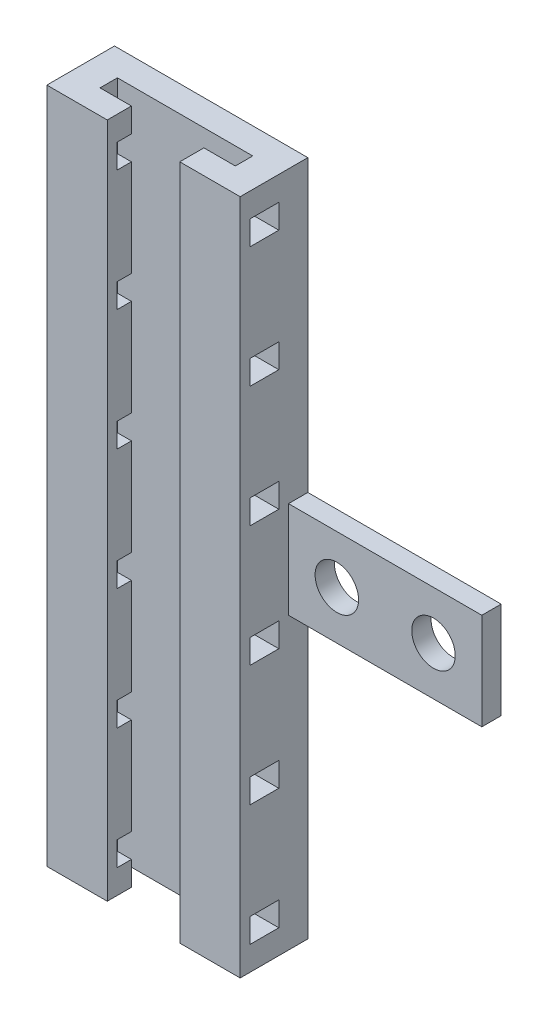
ISO-10303-21;
HEADER;
FILE_DESCRIPTION(('STEP AP214'),'2;1');
FILE_NAME('part.step','',(''),(''),'','','');
FILE_SCHEMA(('AUTOMOTIVE_DESIGN { 1 0 10303 214 1 1 1 1 }'));
ENDSEC;
DATA;
#1=APPLICATION_CONTEXT('core data for automotive mechanical design processes');
#2=APPLICATION_PROTOCOL_DEFINITION('international standard','automotive_design',2000,#1);
#3=PRODUCT_CONTEXT('',#1,'mechanical');
#4=PRODUCT('Part','Part','',(#3));
#5=PRODUCT_RELATED_PRODUCT_CATEGORY('part','',(#4));
#6=PRODUCT_DEFINITION_FORMATION('','',#4);
#7=PRODUCT_DEFINITION_CONTEXT('part definition',#1,'design');
#8=PRODUCT_DEFINITION('design','',#6,#7);
#9=PRODUCT_DEFINITION_SHAPE('','',#8);
#10=(LENGTH_UNIT() NAMED_UNIT(*) SI_UNIT(.MILLI.,.METRE.));
#11=(NAMED_UNIT(*) PLANE_ANGLE_UNIT() SI_UNIT($,.RADIAN.));
#12=(NAMED_UNIT(*) SI_UNIT($,.STERADIAN.) SOLID_ANGLE_UNIT());
#13=UNCERTAINTY_MEASURE_WITH_UNIT(LENGTH_MEASURE(1.E-05),#10,'distance_accuracy_value','');
#14=(GEOMETRIC_REPRESENTATION_CONTEXT(3) GLOBAL_UNCERTAINTY_ASSIGNED_CONTEXT((#13)) GLOBAL_UNIT_ASSIGNED_CONTEXT((#10,
#11,#12)) REPRESENTATION_CONTEXT('',''));
#15=CARTESIAN_POINT('',(0.,0.,0.));
#16=DIRECTION('',(0.,0.,1.));
#17=DIRECTION('',(1.,0.,0.));
#18=AXIS2_PLACEMENT_3D('',#15,#16,#17);
#19=CARTESIAN_POINT('',(3.,70.,-2.5));
#20=DIRECTION('',(0.,0.,1.));
#21=DIRECTION('',(1.,0.,0.));
#22=AXIS2_PLACEMENT_3D('',#19,#20,#21);
#23=PLANE('',#22);
#24=DIRECTION('',(0.,-1.,0.));
#25=VECTOR('',#24,1.);
#26=CARTESIAN_POINT('',(6.25,70.,-2.5));
#27=LINE('',#26,#25);
#28=CARTESIAN_POINT('',(6.25,15.,-2.5));
#29=VERTEX_POINT('',#28);
#30=CARTESIAN_POINT('',(6.25,5.,-2.5));
#31=VERTEX_POINT('',#30);
#32=EDGE_CURVE('E1483',#29,#31,#27,.T.);
#33=ORIENTED_EDGE('',*,*,#32,.T.);
#34=DIRECTION('',(-1.,0.,0.));
#35=VECTOR('',#34,1.);
#36=CARTESIAN_POINT('',(3.,5.,-2.5));
#37=LINE('',#36,#35);
#38=CARTESIAN_POINT('',(3.,5.,-2.5));
#39=VERTEX_POINT('',#38);
#40=EDGE_CURVE('E1157',#31,#39,#37,.T.);
#41=ORIENTED_EDGE('',*,*,#40,.T.);
#42=DIRECTION('',(0.,-1.,0.));
#43=VECTOR('',#42,1.);
#44=CARTESIAN_POINT('',(3.,70.,-2.5));
#45=LINE('',#44,#43);
#46=CARTESIAN_POINT('',(3.,15.,-2.5));
#47=VERTEX_POINT('',#46);
#48=EDGE_CURVE('E2715',#47,#39,#45,.T.);
#49=ORIENTED_EDGE('',*,*,#48,.F.);
#50=DIRECTION('',(1.,0.,0.));
#51=VECTOR('',#50,1.);
#52=CARTESIAN_POINT('',(3.,15.,-2.5));
#53=LINE('',#52,#51);
#54=EDGE_CURVE('E1072',#47,#29,#53,.T.);
#55=ORIENTED_EDGE('',*,*,#54,.T.);
#56=EDGE_LOOP('',(#33,#41,#49,#55));
#57=FACE_BOUND('',#56,.T.);
#58=ADVANCED_FACE('F44',(#57),#23,.F.);
#59=CARTESIAN_POINT('',(6.25,27.5,-2.5));
#60=VERTEX_POINT('',#59);
#61=CARTESIAN_POINT('',(6.25,17.5,-2.5));
#62=VERTEX_POINT('',#61);
#63=EDGE_CURVE('E1486',#60,#62,#27,.T.);
#64=ORIENTED_EDGE('',*,*,#63,.T.);
#65=DIRECTION('',(-1.,0.,0.));
#66=VECTOR('',#65,1.);
#67=CARTESIAN_POINT('',(3.,17.5,-2.5));
#68=LINE('',#67,#66);
#69=CARTESIAN_POINT('',(3.,17.5,-2.5));
#70=VERTEX_POINT('',#69);
#71=EDGE_CURVE('E1104',#62,#70,#68,.T.);
#72=ORIENTED_EDGE('',*,*,#71,.T.);
#73=CARTESIAN_POINT('',(3.,27.5,-2.5));
#74=VERTEX_POINT('',#73);
#75=EDGE_CURVE('E2711',#74,#70,#45,.T.);
#76=ORIENTED_EDGE('',*,*,#75,.F.);
#77=DIRECTION('',(1.,0.,0.));
#78=VECTOR('',#77,1.);
#79=CARTESIAN_POINT('',(3.,27.5,-2.5));
#80=LINE('',#79,#78);
#81=EDGE_CURVE('E1008',#74,#60,#80,.T.);
#82=ORIENTED_EDGE('',*,*,#81,.T.);
#83=EDGE_LOOP('',(#64,#72,#76,#82));
#84=FACE_BOUND('',#83,.T.);
#85=ADVANCED_FACE('F1570',(#84),#23,.F.);
#86=CARTESIAN_POINT('',(6.25,40.,-2.5));
#87=VERTEX_POINT('',#86);
#88=CARTESIAN_POINT('',(6.25,30.,-2.5));
#89=VERTEX_POINT('',#88);
#90=EDGE_CURVE('E1491',#87,#89,#27,.T.);
#91=ORIENTED_EDGE('',*,*,#90,.T.);
#92=DIRECTION('',(-1.,0.,0.));
#93=VECTOR('',#92,1.);
#94=CARTESIAN_POINT('',(3.,30.,-2.5));
#95=LINE('',#94,#93);
#96=CARTESIAN_POINT('',(3.,30.,-2.5));
#97=VERTEX_POINT('',#96);
#98=EDGE_CURVE('E1040',#89,#97,#95,.T.);
#99=ORIENTED_EDGE('',*,*,#98,.T.);
#100=CARTESIAN_POINT('',(3.,40.,-2.5));
#101=VERTEX_POINT('',#100);
#102=EDGE_CURVE('E2707',#101,#97,#45,.T.);
#103=ORIENTED_EDGE('',*,*,#102,.F.);
#104=DIRECTION('',(1.,0.,0.));
#105=VECTOR('',#104,1.);
#106=CARTESIAN_POINT('',(3.,40.,-2.5));
#107=LINE('',#106,#105);
#108=EDGE_CURVE('E944',#101,#87,#107,.T.);
#109=ORIENTED_EDGE('',*,*,#108,.T.);
#110=EDGE_LOOP('',(#91,#99,#103,#109));
#111=FACE_BOUND('',#110,.T.);
#112=ADVANCED_FACE('F1576',(#111),#23,.F.);
#113=CARTESIAN_POINT('',(6.25,52.5,-2.5));
#114=VERTEX_POINT('',#113);
#115=CARTESIAN_POINT('',(6.25,42.5,-2.5));
#116=VERTEX_POINT('',#115);
#117=EDGE_CURVE('E1496',#114,#116,#27,.T.);
#118=ORIENTED_EDGE('',*,*,#117,.T.);
#119=DIRECTION('',(-1.,0.,0.));
#120=VECTOR('',#119,1.);
#121=CARTESIAN_POINT('',(3.,42.5,-2.5));
#122=LINE('',#121,#120);
#123=CARTESIAN_POINT('',(3.,42.5,-2.5));
#124=VERTEX_POINT('',#123);
#125=EDGE_CURVE('E976',#116,#124,#122,.T.);
#126=ORIENTED_EDGE('',*,*,#125,.T.);
#127=CARTESIAN_POINT('',(3.,52.5,-2.5));
#128=VERTEX_POINT('',#127);
#129=EDGE_CURVE('E2705',#128,#124,#45,.T.);
#130=ORIENTED_EDGE('',*,*,#129,.F.);
#131=DIRECTION('',(1.,0.,0.));
#132=VECTOR('',#131,1.);
#133=CARTESIAN_POINT('',(3.,52.5,-2.5));
#134=LINE('',#133,#132);
#135=EDGE_CURVE('E880',#128,#114,#134,.T.);
#136=ORIENTED_EDGE('',*,*,#135,.T.);
#137=EDGE_LOOP('',(#118,#126,#130,#136));
#138=FACE_BOUND('',#137,.T.);
#139=ADVANCED_FACE('F1595',(#138),#23,.F.);
#140=CARTESIAN_POINT('',(6.25,65.,-2.5));
#141=VERTEX_POINT('',#140);
#142=CARTESIAN_POINT('',(6.25,55.,-2.5));
#143=VERTEX_POINT('',#142);
#144=EDGE_CURVE('E1362',#141,#143,#27,.T.);
#145=ORIENTED_EDGE('',*,*,#144,.T.);
#146=DIRECTION('',(-1.,0.,0.));
#147=VECTOR('',#146,1.);
#148=CARTESIAN_POINT('',(3.,55.,-2.5));
#149=LINE('',#148,#147);
#150=CARTESIAN_POINT('',(3.,55.,-2.5));
#151=VERTEX_POINT('',#150);
#152=EDGE_CURVE('E912',#143,#151,#149,.T.);
#153=ORIENTED_EDGE('',*,*,#152,.T.);
#154=CARTESIAN_POINT('',(3.,65.,-2.5));
#155=VERTEX_POINT('',#154);
#156=EDGE_CURVE('E1356',#155,#151,#45,.T.);
#157=ORIENTED_EDGE('',*,*,#156,.F.);
#158=DIRECTION('',(1.,0.,0.));
#159=VECTOR('',#158,1.);
#160=CARTESIAN_POINT('',(3.,65.,-2.5));
#161=LINE('',#160,#159);
#162=EDGE_CURVE('E816',#155,#141,#161,.T.);
#163=ORIENTED_EDGE('',*,*,#162,.T.);
#164=EDGE_LOOP('',(#145,#153,#157,#163));
#165=FACE_BOUND('',#164,.T.);
#166=ADVANCED_FACE('F1507',(#165),#23,.F.);
#167=CARTESIAN_POINT('',(6.25,70.,-2.5));
#168=VERTEX_POINT('',#167);
#169=CARTESIAN_POINT('',(6.25,67.5,-2.5));
#170=VERTEX_POINT('',#169);
#171=EDGE_CURVE('E1357',#168,#170,#27,.T.);
#172=ORIENTED_EDGE('',*,*,#171,.T.);
#173=DIRECTION('',(-1.,0.,0.));
#174=VECTOR('',#173,1.);
#175=CARTESIAN_POINT('',(3.,67.5,-2.5));
#176=LINE('',#175,#174);
#177=CARTESIAN_POINT('',(3.,67.5,-2.5));
#178=VERTEX_POINT('',#177);
#179=EDGE_CURVE('E848',#170,#178,#176,.T.);
#180=ORIENTED_EDGE('',*,*,#179,.T.);
#181=CARTESIAN_POINT('',(3.,70.,-2.5));
#182=VERTEX_POINT('',#181);
#183=EDGE_CURVE('E1351',#182,#178,#45,.T.);
#184=ORIENTED_EDGE('',*,*,#183,.F.);
#185=DIRECTION('',(-1.,0.,0.));
#186=VECTOR('',#185,1.);
#187=CARTESIAN_POINT('',(3.,70.,-2.5));
#188=LINE('',#187,#186);
#189=EDGE_CURVE('E1239',#168,#182,#188,.T.);
#190=ORIENTED_EDGE('',*,*,#189,.F.);
#191=EDGE_LOOP('',(#172,#180,#184,#190));
#192=FACE_BOUND('',#191,.T.);
#193=ADVANCED_FACE('F1544',(#192),#23,.F.);
#194=CARTESIAN_POINT('',(13.75,70.,-2.5));
#195=DIRECTION('',(0.,0.,1.));
#196=DIRECTION('',(1.,0.,0.));
#197=AXIS2_PLACEMENT_3D('',#194,#195,#196);
#198=PLANE('',#197);
#199=DIRECTION('',(0.,-1.,0.));
#200=VECTOR('',#199,1.);
#201=CARTESIAN_POINT('',(17.,70.,-2.5));
#202=LINE('',#201,#200);
#203=CARTESIAN_POINT('',(17.,15.,-2.5));
#204=VERTEX_POINT('',#203);
#205=CARTESIAN_POINT('',(17.,5.,-2.5));
#206=VERTEX_POINT('',#205);
#207=EDGE_CURVE('E2630',#204,#206,#202,.T.);
#208=ORIENTED_EDGE('',*,*,#207,.T.);
#209=DIRECTION('',(-1.,0.,0.));
#210=VECTOR('',#209,1.);
#211=CARTESIAN_POINT('',(13.75,5.,-2.5));
#212=LINE('',#211,#210);
#213=CARTESIAN_POINT('',(13.75,5.,-2.5));
#214=VERTEX_POINT('',#213);
#215=EDGE_CURVE('E1145',#206,#214,#212,.T.);
#216=ORIENTED_EDGE('',*,*,#215,.T.);
#217=DIRECTION('',(0.,-1.,0.));
#218=VECTOR('',#217,1.);
#219=CARTESIAN_POINT('',(13.75,70.,-2.5));
#220=LINE('',#219,#218);
#221=CARTESIAN_POINT('',(13.75,15.,-2.5));
#222=VERTEX_POINT('',#221);
#223=EDGE_CURVE('E2670',#222,#214,#220,.T.);
#224=ORIENTED_EDGE('',*,*,#223,.F.);
#225=DIRECTION('',(1.,0.,0.));
#226=VECTOR('',#225,1.);
#227=CARTESIAN_POINT('',(13.75,15.,-2.5));
#228=LINE('',#227,#226);
#229=EDGE_CURVE('E1060',#222,#204,#228,.T.);
#230=ORIENTED_EDGE('',*,*,#229,.T.);
#231=EDGE_LOOP('',(#208,#216,#224,#230));
#232=FACE_BOUND('',#231,.T.);
#233=ADVANCED_FACE('F1586',(#232),#198,.F.);
#234=CARTESIAN_POINT('',(17.,27.5,-2.5));
#235=VERTEX_POINT('',#234);
#236=CARTESIAN_POINT('',(17.,17.5,-2.5));
#237=VERTEX_POINT('',#236);
#238=EDGE_CURVE('E2633',#235,#237,#202,.T.);
#239=ORIENTED_EDGE('',*,*,#238,.T.);
#240=DIRECTION('',(-1.,0.,0.));
#241=VECTOR('',#240,1.);
#242=CARTESIAN_POINT('',(13.75,17.5,-2.5));
#243=LINE('',#242,#241);
#244=CARTESIAN_POINT('',(13.75,17.5,-2.5));
#245=VERTEX_POINT('',#244);
#246=EDGE_CURVE('E1092',#237,#245,#243,.T.);
#247=ORIENTED_EDGE('',*,*,#246,.T.);
#248=CARTESIAN_POINT('',(13.75,27.5,-2.5));
#249=VERTEX_POINT('',#248);
#250=EDGE_CURVE('E2666',#249,#245,#220,.T.);
#251=ORIENTED_EDGE('',*,*,#250,.F.);
#252=DIRECTION('',(1.,0.,0.));
#253=VECTOR('',#252,1.);
#254=CARTESIAN_POINT('',(13.75,27.5,-2.5));
#255=LINE('',#254,#253);
#256=EDGE_CURVE('E996',#249,#235,#255,.T.);
#257=ORIENTED_EDGE('',*,*,#256,.T.);
#258=EDGE_LOOP('',(#239,#247,#251,#257));
#259=FACE_BOUND('',#258,.T.);
#260=ADVANCED_FACE('F1591',(#259),#198,.F.);
#261=CARTESIAN_POINT('',(17.,40.,-2.5));
#262=VERTEX_POINT('',#261);
#263=CARTESIAN_POINT('',(17.,30.,-2.5));
#264=VERTEX_POINT('',#263);
#265=EDGE_CURVE('E2637',#262,#264,#202,.T.);
#266=ORIENTED_EDGE('',*,*,#265,.T.);
#267=DIRECTION('',(-1.,0.,0.));
#268=VECTOR('',#267,1.);
#269=CARTESIAN_POINT('',(13.75,30.,-2.5));
#270=LINE('',#269,#268);
#271=CARTESIAN_POINT('',(13.75,30.,-2.5));
#272=VERTEX_POINT('',#271);
#273=EDGE_CURVE('E1028',#264,#272,#270,.T.);
#274=ORIENTED_EDGE('',*,*,#273,.T.);
#275=CARTESIAN_POINT('',(13.75,40.,-2.5));
#276=VERTEX_POINT('',#275);
#277=EDGE_CURVE('E2663',#276,#272,#220,.T.);
#278=ORIENTED_EDGE('',*,*,#277,.F.);
#279=DIRECTION('',(1.,0.,0.));
#280=VECTOR('',#279,1.);
#281=CARTESIAN_POINT('',(13.75,40.,-2.5));
#282=LINE('',#281,#280);
#283=EDGE_CURVE('E932',#276,#262,#282,.T.);
#284=ORIENTED_EDGE('',*,*,#283,.T.);
#285=EDGE_LOOP('',(#266,#274,#278,#284));
#286=FACE_BOUND('',#285,.T.);
#287=ADVANCED_FACE('F2476',(#286),#198,.F.);
#288=CARTESIAN_POINT('',(17.,52.5,-2.5));
#289=VERTEX_POINT('',#288);
#290=CARTESIAN_POINT('',(17.,42.5,-2.5));
#291=VERTEX_POINT('',#290);
#292=EDGE_CURVE('E2641',#289,#291,#202,.T.);
#293=ORIENTED_EDGE('',*,*,#292,.T.);
#294=DIRECTION('',(-1.,0.,0.));
#295=VECTOR('',#294,1.);
#296=CARTESIAN_POINT('',(13.75,42.5,-2.5));
#297=LINE('',#296,#295);
#298=CARTESIAN_POINT('',(13.75,42.5,-2.5));
#299=VERTEX_POINT('',#298);
#300=EDGE_CURVE('E964',#291,#299,#297,.T.);
#301=ORIENTED_EDGE('',*,*,#300,.T.);
#302=CARTESIAN_POINT('',(13.75,52.5,-2.5));
#303=VERTEX_POINT('',#302);
#304=EDGE_CURVE('E2661',#303,#299,#220,.T.);
#305=ORIENTED_EDGE('',*,*,#304,.F.);
#306=DIRECTION('',(1.,0.,0.));
#307=VECTOR('',#306,1.);
#308=CARTESIAN_POINT('',(13.75,52.5,-2.5));
#309=LINE('',#308,#307);
#310=EDGE_CURVE('E868',#303,#289,#309,.T.);
#311=ORIENTED_EDGE('',*,*,#310,.T.);
#312=EDGE_LOOP('',(#293,#301,#305,#311));
#313=FACE_BOUND('',#312,.T.);
#314=ADVANCED_FACE('F2485',(#313),#198,.F.);
#315=CARTESIAN_POINT('',(17.,65.,-2.5));
#316=VERTEX_POINT('',#315);
#317=CARTESIAN_POINT('',(17.,55.,-2.5));
#318=VERTEX_POINT('',#317);
#319=EDGE_CURVE('E1342',#316,#318,#202,.T.);
#320=ORIENTED_EDGE('',*,*,#319,.T.);
#321=DIRECTION('',(-1.,0.,0.));
#322=VECTOR('',#321,1.);
#323=CARTESIAN_POINT('',(13.75,55.,-2.5));
#324=LINE('',#323,#322);
#325=CARTESIAN_POINT('',(13.75,55.,-2.5));
#326=VERTEX_POINT('',#325);
#327=EDGE_CURVE('E900',#318,#326,#324,.T.);
#328=ORIENTED_EDGE('',*,*,#327,.T.);
#329=CARTESIAN_POINT('',(13.75,65.,-2.5));
#330=VERTEX_POINT('',#329);
#331=EDGE_CURVE('E1336',#330,#326,#220,.T.);
#332=ORIENTED_EDGE('',*,*,#331,.F.);
#333=DIRECTION('',(1.,0.,0.));
#334=VECTOR('',#333,1.);
#335=CARTESIAN_POINT('',(13.75,65.,-2.5));
#336=LINE('',#335,#334);
#337=EDGE_CURVE('E804',#330,#316,#336,.T.);
#338=ORIENTED_EDGE('',*,*,#337,.T.);
#339=EDGE_LOOP('',(#320,#328,#332,#338));
#340=FACE_BOUND('',#339,.T.);
#341=ADVANCED_FACE('F2494',(#340),#198,.F.);
#342=CARTESIAN_POINT('',(17.,70.,-2.5));
#343=VERTEX_POINT('',#342);
#344=CARTESIAN_POINT('',(17.,67.5,-2.5));
#345=VERTEX_POINT('',#344);
#346=EDGE_CURVE('E1337',#343,#345,#202,.T.);
#347=ORIENTED_EDGE('',*,*,#346,.T.);
#348=DIRECTION('',(-1.,0.,0.));
#349=VECTOR('',#348,1.);
#350=CARTESIAN_POINT('',(13.75,67.5,-2.5));
#351=LINE('',#350,#349);
#352=CARTESIAN_POINT('',(13.75,67.5,-2.5));
#353=VERTEX_POINT('',#352);
#354=EDGE_CURVE('E836',#345,#353,#351,.T.);
#355=ORIENTED_EDGE('',*,*,#354,.T.);
#356=CARTESIAN_POINT('',(13.75,70.,-2.5));
#357=VERTEX_POINT('',#356);
#358=EDGE_CURVE('E1331',#357,#353,#220,.T.);
#359=ORIENTED_EDGE('',*,*,#358,.F.);
#360=DIRECTION('',(-1.,0.,0.));
#361=VECTOR('',#360,1.);
#362=CARTESIAN_POINT('',(13.75,70.,-2.5));
#363=LINE('',#362,#361);
#364=EDGE_CURVE('E1251',#343,#357,#363,.T.);
#365=ORIENTED_EDGE('',*,*,#364,.F.);
#366=EDGE_LOOP('',(#347,#355,#359,#365));
#367=FACE_BOUND('',#366,.T.);
#368=ADVANCED_FACE('F1804',(#367),#198,.F.);
#369=CARTESIAN_POINT('',(20.,70.,0.));
#370=DIRECTION('',(-1.,0.,0.));
#371=DIRECTION('',(0.,0.,1.));
#372=AXIS2_PLACEMENT_3D('',#369,#370,#371);
#373=PLANE('',#372);
#374=DIRECTION('',(0.,0.,-1.));
#375=VECTOR('',#374,1.);
#376=CARTESIAN_POINT('',(20.,2.5,-1.));
#377=LINE('',#376,#375);
#378=CARTESIAN_POINT('',(20.,2.5,-1.));
#379=VERTEX_POINT('',#378);
#380=CARTESIAN_POINT('',(20.,2.5,-4.));
#381=VERTEX_POINT('',#380);
#382=EDGE_CURVE('E608',#379,#381,#377,.T.);
#383=ORIENTED_EDGE('',*,*,#382,.F.);
#384=DIRECTION('',(0.,-1.,0.));
#385=VECTOR('',#384,1.);
#386=CARTESIAN_POINT('',(20.,5.,-1.));
#387=LINE('',#386,#385);
#388=CARTESIAN_POINT('',(20.,5.,-1.));
#389=VERTEX_POINT('',#388);
#390=EDGE_CURVE('E60',#389,#379,#387,.T.);
#391=ORIENTED_EDGE('',*,*,#390,.F.);
#392=DIRECTION('',(0.,0.,1.));
#393=VECTOR('',#392,1.);
#394=CARTESIAN_POINT('',(20.,5.,-1.));
#395=LINE('',#394,#393);
#396=CARTESIAN_POINT('',(20.,5.,-4.));
#397=VERTEX_POINT('',#396);
#398=EDGE_CURVE('E617',#397,#389,#395,.T.);
#399=ORIENTED_EDGE('',*,*,#398,.F.);
#400=DIRECTION('',(0.,1.,0.));
#401=VECTOR('',#400,1.);
#402=CARTESIAN_POINT('',(20.,5.,-4.));
#403=LINE('',#402,#401);
#404=EDGE_CURVE('E597',#381,#397,#403,.T.);
#405=ORIENTED_EDGE('',*,*,#404,.F.);
#406=EDGE_LOOP('',(#383,#391,#399,#405));
#407=FACE_BOUND('',#406,.T.);
#408=DIRECTION('',(0.,-1.,0.));
#409=VECTOR('',#408,1.);
#410=CARTESIAN_POINT('',(20.,17.5,-1.));
#411=LINE('',#410,#409);
#412=CARTESIAN_POINT('',(20.,17.5,-1.));
#413=VERTEX_POINT('',#412);
#414=CARTESIAN_POINT('',(20.,15.,-1.));
#415=VERTEX_POINT('',#414);
#416=EDGE_CURVE('E659',#413,#415,#411,.T.);
#417=ORIENTED_EDGE('',*,*,#416,.F.);
#418=DIRECTION('',(0.,0.,1.));
#419=VECTOR('',#418,1.);
#420=CARTESIAN_POINT('',(20.,17.5,-1.));
#421=LINE('',#420,#419);
#422=CARTESIAN_POINT('',(20.,17.5,-4.));
#423=VERTEX_POINT('',#422);
#424=EDGE_CURVE('E68',#423,#413,#421,.T.);
#425=ORIENTED_EDGE('',*,*,#424,.F.);
#426=DIRECTION('',(0.,1.,0.));
#427=VECTOR('',#426,1.);
#428=CARTESIAN_POINT('',(20.,17.5,-4.));
#429=LINE('',#428,#427);
#430=CARTESIAN_POINT('',(20.,15.,-4.));
#431=VERTEX_POINT('',#430);
#432=EDGE_CURVE('E651',#431,#423,#429,.T.);
#433=ORIENTED_EDGE('',*,*,#432,.F.);
#434=DIRECTION('',(0.,0.,-1.));
#435=VECTOR('',#434,1.);
#436=CARTESIAN_POINT('',(20.,15.,-1.));
#437=LINE('',#436,#435);
#438=EDGE_CURVE('E655',#415,#431,#437,.T.);
#439=ORIENTED_EDGE('',*,*,#438,.F.);
#440=EDGE_LOOP('',(#417,#425,#433,#439));
#441=FACE_BOUND('',#440,.T.);
#442=DIRECTION('',(0.,-1.,0.));
#443=VECTOR('',#442,1.);
#444=CARTESIAN_POINT('',(20.,30.,-1.));
#445=LINE('',#444,#443);
#446=CARTESIAN_POINT('',(20.,30.,-1.));
#447=VERTEX_POINT('',#446);
#448=CARTESIAN_POINT('',(20.,27.5,-1.));
#449=VERTEX_POINT('',#448);
#450=EDGE_CURVE('E691',#447,#449,#445,.T.);
#451=ORIENTED_EDGE('',*,*,#450,.F.);
#452=DIRECTION('',(0.,0.,1.));
#453=VECTOR('',#452,1.);
#454=CARTESIAN_POINT('',(20.,30.,-1.));
#455=LINE('',#454,#453);
#456=CARTESIAN_POINT('',(20.,30.,-4.));
#457=VERTEX_POINT('',#456);
#458=EDGE_CURVE('E650',#457,#447,#455,.T.);
#459=ORIENTED_EDGE('',*,*,#458,.F.);
#460=DIRECTION('',(0.,1.,0.));
#461=VECTOR('',#460,1.);
#462=CARTESIAN_POINT('',(20.,30.,-4.));
#463=LINE('',#462,#461);
#464=CARTESIAN_POINT('',(20.,27.5,-4.));
#465=VERTEX_POINT('',#464);
#466=EDGE_CURVE('E683',#465,#457,#463,.T.);
#467=ORIENTED_EDGE('',*,*,#466,.F.);
#468=DIRECTION('',(0.,0.,-1.));
#469=VECTOR('',#468,1.);
#470=CARTESIAN_POINT('',(20.,27.5,-1.));
#471=LINE('',#470,#469);
#472=EDGE_CURVE('E687',#449,#465,#471,.T.);
#473=ORIENTED_EDGE('',*,*,#472,.F.);
#474=EDGE_LOOP('',(#451,#459,#467,#473));
#475=FACE_BOUND('',#474,.T.);
#476=DIRECTION('',(0.,-1.,0.));
#477=VECTOR('',#476,1.);
#478=CARTESIAN_POINT('',(20.,42.5,-1.));
#479=LINE('',#478,#477);
#480=CARTESIAN_POINT('',(20.,42.5,-1.));
#481=VERTEX_POINT('',#480);
#482=CARTESIAN_POINT('',(20.,40.,-1.));
#483=VERTEX_POINT('',#482);
#484=EDGE_CURVE('E723',#481,#483,#479,.T.);
#485=ORIENTED_EDGE('',*,*,#484,.F.);
#486=DIRECTION('',(0.,0.,1.));
#487=VECTOR('',#486,1.);
#488=CARTESIAN_POINT('',(20.,42.5,-1.));
#489=LINE('',#488,#487);
#490=CARTESIAN_POINT('',(20.,42.5,-4.));
#491=VERTEX_POINT('',#490);
#492=EDGE_CURVE('E682',#491,#481,#489,.T.);
#493=ORIENTED_EDGE('',*,*,#492,.F.);
#494=DIRECTION('',(0.,1.,0.));
#495=VECTOR('',#494,1.);
#496=CARTESIAN_POINT('',(20.,42.5,-4.));
#497=LINE('',#496,#495);
#498=CARTESIAN_POINT('',(20.,40.,-4.));
#499=VERTEX_POINT('',#498);
#500=EDGE_CURVE('E715',#499,#491,#497,.T.);
#501=ORIENTED_EDGE('',*,*,#500,.F.);
#502=DIRECTION('',(0.,0.,-1.));
#503=VECTOR('',#502,1.);
#504=CARTESIAN_POINT('',(20.,40.,-1.));
#505=LINE('',#504,#503);
#506=EDGE_CURVE('E719',#483,#499,#505,.T.);
#507=ORIENTED_EDGE('',*,*,#506,.F.);
#508=EDGE_LOOP('',(#485,#493,#501,#507));
#509=FACE_BOUND('',#508,.T.);
#510=DIRECTION('',(0.,-1.,0.));
#511=VECTOR('',#510,1.);
#512=CARTESIAN_POINT('',(20.,55.,-1.));
#513=LINE('',#512,#511);
#514=CARTESIAN_POINT('',(20.,55.,-1.));
#515=VERTEX_POINT('',#514);
#516=CARTESIAN_POINT('',(20.,52.5,-1.));
#517=VERTEX_POINT('',#516);
#518=EDGE_CURVE('E755',#515,#517,#513,.T.);
#519=ORIENTED_EDGE('',*,*,#518,.F.);
#520=DIRECTION('',(0.,0.,1.));
#521=VECTOR('',#520,1.);
#522=CARTESIAN_POINT('',(20.,55.,-1.));
#523=LINE('',#522,#521);
#524=CARTESIAN_POINT('',(20.,55.,-4.));
#525=VERTEX_POINT('',#524);
#526=EDGE_CURVE('E714',#525,#515,#523,.T.);
#527=ORIENTED_EDGE('',*,*,#526,.F.);
#528=DIRECTION('',(0.,1.,0.));
#529=VECTOR('',#528,1.);
#530=CARTESIAN_POINT('',(20.,55.,-4.));
#531=LINE('',#530,#529);
#532=CARTESIAN_POINT('',(20.,52.5,-4.));
#533=VERTEX_POINT('',#532);
#534=EDGE_CURVE('E747',#533,#525,#531,.T.);
#535=ORIENTED_EDGE('',*,*,#534,.F.);
#536=DIRECTION('',(0.,0.,-1.));
#537=VECTOR('',#536,1.);
#538=CARTESIAN_POINT('',(20.,52.5,-1.));
#539=LINE('',#538,#537);
#540=EDGE_CURVE('E751',#517,#533,#539,.T.);
#541=ORIENTED_EDGE('',*,*,#540,.F.);
#542=EDGE_LOOP('',(#519,#527,#535,#541));
#543=FACE_BOUND('',#542,.T.);
#544=DIRECTION('',(0.,-1.,0.));
#545=VECTOR('',#544,1.);
#546=CARTESIAN_POINT('',(20.,67.5,-1.));
#547=LINE('',#546,#545);
#548=CARTESIAN_POINT('',(20.,67.5,-1.));
#549=VERTEX_POINT('',#548);
#550=CARTESIAN_POINT('',(20.,65.,-1.));
#551=VERTEX_POINT('',#550);
#552=EDGE_CURVE('E786',#549,#551,#547,.T.);
#553=ORIENTED_EDGE('',*,*,#552,.F.);
#554=DIRECTION('',(0.,0.,1.));
#555=VECTOR('',#554,1.);
#556=CARTESIAN_POINT('',(20.,67.5,-1.));
#557=LINE('',#556,#555);
#558=CARTESIAN_POINT('',(20.,67.5,-4.));
#559=VERTEX_POINT('',#558);
#560=EDGE_CURVE('E746',#559,#549,#557,.T.);
#561=ORIENTED_EDGE('',*,*,#560,.F.);
#562=DIRECTION('',(0.,1.,0.));
#563=VECTOR('',#562,1.);
#564=CARTESIAN_POINT('',(20.,67.5,-4.));
#565=LINE('',#564,#563);
#566=CARTESIAN_POINT('',(20.,65.,-4.));
#567=VERTEX_POINT('',#566);
#568=EDGE_CURVE('E778',#567,#559,#565,.T.);
#569=ORIENTED_EDGE('',*,*,#568,.F.);
#570=DIRECTION('',(0.,0.,-1.));
#571=VECTOR('',#570,1.);
#572=CARTESIAN_POINT('',(20.,65.,-1.));
#573=LINE('',#572,#571);
#574=EDGE_CURVE('E782',#551,#567,#573,.T.);
#575=ORIENTED_EDGE('',*,*,#574,.F.);
#576=EDGE_LOOP('',(#553,#561,#569,#575));
#577=FACE_BOUND('',#576,.T.);
#578=DIRECTION('',(0.,0.,-1.));
#579=VECTOR('',#578,1.);
#580=CARTESIAN_POINT('',(20.,30.,-7.));
#581=LINE('',#580,#579);
#582=CARTESIAN_POINT('',(20.,30.,-5.));
#583=VERTEX_POINT('',#582);
#584=CARTESIAN_POINT('',(20.,30.,-7.));
#585=VERTEX_POINT('',#584);
#586=EDGE_CURVE('E1195',#583,#585,#581,.T.);
#587=ORIENTED_EDGE('',*,*,#586,.F.);
#588=DIRECTION('',(0.,-1.,0.));
#589=VECTOR('',#588,1.);
#590=CARTESIAN_POINT('',(20.,40.,-5.));
#591=LINE('',#590,#589);
#592=CARTESIAN_POINT('',(20.,40.,-5.));
#593=VERTEX_POINT('',#592);
#594=EDGE_CURVE('E1208',#593,#583,#591,.T.);
#595=ORIENTED_EDGE('',*,*,#594,.F.);
#596=DIRECTION('',(0.,0.,1.));
#597=VECTOR('',#596,1.);
#598=CARTESIAN_POINT('',(20.,40.,-7.));
#599=LINE('',#598,#597);
#600=CARTESIAN_POINT('',(20.,40.,-7.));
#601=VERTEX_POINT('',#600);
#602=EDGE_CURVE('E1189',#601,#593,#599,.T.);
#603=ORIENTED_EDGE('',*,*,#602,.F.);
#604=DIRECTION('',(0.,-1.,0.));
#605=VECTOR('',#604,1.);
#606=CARTESIAN_POINT('',(20.,70.,-7.));
#607=LINE('',#606,#605);
#608=CARTESIAN_POINT('',(20.,70.,-7.));
#609=VERTEX_POINT('',#608);
#610=EDGE_CURVE('E1318',#609,#601,#607,.T.);
#611=ORIENTED_EDGE('',*,*,#610,.F.);
#612=DIRECTION('',(0.,0.,-1.));
#613=VECTOR('',#612,1.);
#614=CARTESIAN_POINT('',(20.,70.,0.));
#615=LINE('',#614,#613);
#616=CARTESIAN_POINT('',(20.,70.,0.));
#617=VERTEX_POINT('',#616);
#618=EDGE_CURVE('E1260',#617,#609,#615,.T.);
#619=ORIENTED_EDGE('',*,*,#618,.F.);
#620=DIRECTION('',(0.,-1.,0.));
#621=VECTOR('',#620,1.);
#622=CARTESIAN_POINT('',(20.,70.,0.));
#623=LINE('',#622,#621);
#624=CARTESIAN_POINT('',(20.,0.,0.));
#625=VERTEX_POINT('',#624);
#626=EDGE_CURVE('E1322',#617,#625,#623,.T.);
#627=ORIENTED_EDGE('',*,*,#626,.T.);
#628=DIRECTION('',(0.,0.,-1.));
#629=VECTOR('',#628,1.);
#630=CARTESIAN_POINT('',(20.,0.,0.));
#631=LINE('',#630,#629);
#632=CARTESIAN_POINT('',(20.,0.,-7.));
#633=VERTEX_POINT('',#632);
#634=EDGE_CURVE('E1301',#625,#633,#631,.T.);
#635=ORIENTED_EDGE('',*,*,#634,.T.);
#636=EDGE_CURVE('E1317',#585,#633,#607,.T.);
#637=ORIENTED_EDGE('',*,*,#636,.F.);
#638=EDGE_LOOP('',(#587,#595,#603,#611,#619,#627,#635,#637));
#639=FACE_BOUND('',#638,.T.);
#640=ADVANCED_FACE('F614',(#407,#441,#475,#509,#543,#577,#639),#373,.F.);
#641=CARTESIAN_POINT('',(0.,70.,0.));
#642=DIRECTION('',(0.,0.,-1.));
#643=DIRECTION('',(-1.,0.,0.));
#644=AXIS2_PLACEMENT_3D('',#641,#642,#643);
#645=PLANE('',#644);
#646=DIRECTION('',(1.,0.,0.));
#647=VECTOR('',#646,1.);
#648=CARTESIAN_POINT('',(0.,0.,0.));
#649=LINE('',#648,#647);
#650=CARTESIAN_POINT('',(0.,0.,0.));
#651=VERTEX_POINT('',#650);
#652=CARTESIAN_POINT('',(6.25,0.,0.));
#653=VERTEX_POINT('',#652);
#654=EDGE_CURVE('E1230',#651,#653,#649,.T.);
#655=ORIENTED_EDGE('',*,*,#654,.T.);
#656=DIRECTION('',(0.,-1.,0.));
#657=VECTOR('',#656,1.);
#658=CARTESIAN_POINT('',(6.25,70.,0.));
#659=LINE('',#658,#657);
#660=CARTESIAN_POINT('',(6.25,70.,0.));
#661=VERTEX_POINT('',#660);
#662=EDGE_CURVE('E1361',#661,#653,#659,.T.);
#663=ORIENTED_EDGE('',*,*,#662,.F.);
#664=DIRECTION('',(1.,0.,0.));
#665=VECTOR('',#664,1.);
#666=CARTESIAN_POINT('',(0.,70.,0.));
#667=LINE('',#666,#665);
#668=CARTESIAN_POINT('',(0.,70.,0.));
#669=VERTEX_POINT('',#668);
#670=EDGE_CURVE('E1231',#669,#661,#667,.T.);
#671=ORIENTED_EDGE('',*,*,#670,.F.);
#672=DIRECTION('',(0.,-1.,0.));
#673=VECTOR('',#672,1.);
#674=CARTESIAN_POINT('',(0.,70.,0.));
#675=LINE('',#674,#673);
#676=EDGE_CURVE('E1269',#669,#651,#675,.T.);
#677=ORIENTED_EDGE('',*,*,#676,.T.);
#678=EDGE_LOOP('',(#655,#663,#671,#677));
#679=FACE_BOUND('',#678,.T.);
#680=ADVANCED_FACE('F46',(#679),#645,.F.);
#681=CARTESIAN_POINT('',(6.25,70.,0.));
#682=DIRECTION('',(-1.,0.,0.));
#683=DIRECTION('',(0.,0.,1.));
#684=AXIS2_PLACEMENT_3D('',#681,#682,#683);
#685=PLANE('',#684);
#686=DIRECTION('',(0.,1.,0.));
#687=VECTOR('',#686,1.);
#688=CARTESIAN_POINT('',(6.25,70.,-1.));
#689=LINE('',#688,#687);
#690=CARTESIAN_POINT('',(6.25,2.5,-1.));
#691=VERTEX_POINT('',#690);
#692=CARTESIAN_POINT('',(6.25,5.,-1.));
#693=VERTEX_POINT('',#692);
#694=EDGE_CURVE('E1169',#691,#693,#689,.T.);
#695=ORIENTED_EDGE('',*,*,#694,.T.);
#696=DIRECTION('',(0.,0.,-1.));
#697=VECTOR('',#696,1.);
#698=CARTESIAN_POINT('',(6.25,5.,0.));
#699=LINE('',#698,#697);
#700=EDGE_CURVE('E1161',#693,#31,#699,.T.);
#701=ORIENTED_EDGE('',*,*,#700,.T.);
#702=ORIENTED_EDGE('',*,*,#32,.F.);
#703=DIRECTION('',(0.,0.,1.));
#704=VECTOR('',#703,1.);
#705=CARTESIAN_POINT('',(6.25,15.,0.));
#706=LINE('',#705,#704);
#707=CARTESIAN_POINT('',(6.25,15.,-1.));
#708=VERTEX_POINT('',#707);
#709=EDGE_CURVE('E1076',#29,#708,#706,.T.);
#710=ORIENTED_EDGE('',*,*,#709,.T.);
#711=DIRECTION('',(0.,1.,0.));
#712=VECTOR('',#711,1.);
#713=CARTESIAN_POINT('',(6.25,70.,-1.));
#714=LINE('',#713,#712);
#715=CARTESIAN_POINT('',(6.25,17.5,-1.));
#716=VERTEX_POINT('',#715);
#717=EDGE_CURVE('E1052',#708,#716,#714,.T.);
#718=ORIENTED_EDGE('',*,*,#717,.T.);
#719=DIRECTION('',(0.,0.,-1.));
#720=VECTOR('',#719,1.);
#721=CARTESIAN_POINT('',(6.25,17.5,0.));
#722=LINE('',#721,#720);
#723=EDGE_CURVE('E1108',#716,#62,#722,.T.);
#724=ORIENTED_EDGE('',*,*,#723,.T.);
#725=ORIENTED_EDGE('',*,*,#63,.F.);
#726=DIRECTION('',(0.,0.,1.));
#727=VECTOR('',#726,1.);
#728=CARTESIAN_POINT('',(6.25,27.5,0.));
#729=LINE('',#728,#727);
#730=CARTESIAN_POINT('',(6.25,27.5,-1.));
#731=VERTEX_POINT('',#730);
#732=EDGE_CURVE('E1012',#60,#731,#729,.T.);
#733=ORIENTED_EDGE('',*,*,#732,.T.);
#734=DIRECTION('',(0.,1.,0.));
#735=VECTOR('',#734,1.);
#736=CARTESIAN_POINT('',(6.25,70.,-1.));
#737=LINE('',#736,#735);
#738=CARTESIAN_POINT('',(6.25,30.,-1.));
#739=VERTEX_POINT('',#738);
#740=EDGE_CURVE('E988',#731,#739,#737,.T.);
#741=ORIENTED_EDGE('',*,*,#740,.T.);
#742=DIRECTION('',(0.,0.,-1.));
#743=VECTOR('',#742,1.);
#744=CARTESIAN_POINT('',(6.25,30.,0.));
#745=LINE('',#744,#743);
#746=EDGE_CURVE('E1044',#739,#89,#745,.T.);
#747=ORIENTED_EDGE('',*,*,#746,.T.);
#748=ORIENTED_EDGE('',*,*,#90,.F.);
#749=DIRECTION('',(0.,0.,1.));
#750=VECTOR('',#749,1.);
#751=CARTESIAN_POINT('',(6.25,40.,0.));
#752=LINE('',#751,#750);
#753=CARTESIAN_POINT('',(6.25,40.,-1.));
#754=VERTEX_POINT('',#753);
#755=EDGE_CURVE('E948',#87,#754,#752,.T.);
#756=ORIENTED_EDGE('',*,*,#755,.T.);
#757=DIRECTION('',(0.,1.,0.));
#758=VECTOR('',#757,1.);
#759=CARTESIAN_POINT('',(6.25,70.,-1.));
#760=LINE('',#759,#758);
#761=CARTESIAN_POINT('',(6.25,42.5,-1.));
#762=VERTEX_POINT('',#761);
#763=EDGE_CURVE('E924',#754,#762,#760,.T.);
#764=ORIENTED_EDGE('',*,*,#763,.T.);
#765=DIRECTION('',(0.,0.,-1.));
#766=VECTOR('',#765,1.);
#767=CARTESIAN_POINT('',(6.25,42.5,0.));
#768=LINE('',#767,#766);
#769=EDGE_CURVE('E980',#762,#116,#768,.T.);
#770=ORIENTED_EDGE('',*,*,#769,.T.);
#771=ORIENTED_EDGE('',*,*,#117,.F.);
#772=DIRECTION('',(0.,0.,1.));
#773=VECTOR('',#772,1.);
#774=CARTESIAN_POINT('',(6.25,52.5,0.));
#775=LINE('',#774,#773);
#776=CARTESIAN_POINT('',(6.25,52.5,-1.));
#777=VERTEX_POINT('',#776);
#778=EDGE_CURVE('E884',#114,#777,#775,.T.);
#779=ORIENTED_EDGE('',*,*,#778,.T.);
#780=DIRECTION('',(0.,1.,0.));
#781=VECTOR('',#780,1.);
#782=CARTESIAN_POINT('',(6.25,70.,-1.));
#783=LINE('',#782,#781);
#784=CARTESIAN_POINT('',(6.25,55.,-1.));
#785=VERTEX_POINT('',#784);
#786=EDGE_CURVE('E860',#777,#785,#783,.T.);
#787=ORIENTED_EDGE('',*,*,#786,.T.);
#788=DIRECTION('',(0.,0.,-1.));
#789=VECTOR('',#788,1.);
#790=CARTESIAN_POINT('',(6.25,55.,0.));
#791=LINE('',#790,#789);
#792=EDGE_CURVE('E916',#785,#143,#791,.T.);
#793=ORIENTED_EDGE('',*,*,#792,.T.);
#794=ORIENTED_EDGE('',*,*,#144,.F.);
#795=DIRECTION('',(0.,0.,1.));
#796=VECTOR('',#795,1.);
#797=CARTESIAN_POINT('',(6.25,65.,0.));
#798=LINE('',#797,#796);
#799=CARTESIAN_POINT('',(6.25,65.,-1.));
#800=VERTEX_POINT('',#799);
#801=EDGE_CURVE('E820',#141,#800,#798,.T.);
#802=ORIENTED_EDGE('',*,*,#801,.T.);
#803=DIRECTION('',(0.,1.,0.));
#804=VECTOR('',#803,1.);
#805=CARTESIAN_POINT('',(6.25,70.,-1.));
#806=LINE('',#805,#804);
#807=CARTESIAN_POINT('',(6.25,67.5,-1.));
#808=VERTEX_POINT('',#807);
#809=EDGE_CURVE('E796',#800,#808,#806,.T.);
#810=ORIENTED_EDGE('',*,*,#809,.T.);
#811=DIRECTION('',(0.,0.,-1.));
#812=VECTOR('',#811,1.);
#813=CARTESIAN_POINT('',(6.25,67.5,0.));
#814=LINE('',#813,#812);
#815=EDGE_CURVE('E852',#808,#170,#814,.T.);
#816=ORIENTED_EDGE('',*,*,#815,.T.);
#817=ORIENTED_EDGE('',*,*,#171,.F.);
#818=DIRECTION('',(0.,0.,-1.));
#819=VECTOR('',#818,1.);
#820=CARTESIAN_POINT('',(6.25,70.,0.));
#821=LINE('',#820,#819);
#822=EDGE_CURVE('E1235',#661,#168,#821,.T.);
#823=ORIENTED_EDGE('',*,*,#822,.F.);
#824=ORIENTED_EDGE('',*,*,#662,.T.);
#825=DIRECTION('',(0.,0.,-1.));
#826=VECTOR('',#825,1.);
#827=CARTESIAN_POINT('',(6.25,0.,0.));
#828=LINE('',#827,#826);
#829=CARTESIAN_POINT('',(6.25,0.,-2.5));
#830=VERTEX_POINT('',#829);
#831=EDGE_CURVE('E1273',#653,#830,#828,.T.);
#832=ORIENTED_EDGE('',*,*,#831,.T.);
#833=CARTESIAN_POINT('',(6.25,2.5,-2.5));
#834=VERTEX_POINT('',#833);
#835=EDGE_CURVE('E1355',#834,#830,#27,.T.);
#836=ORIENTED_EDGE('',*,*,#835,.F.);
#837=DIRECTION('',(0.,0.,1.));
#838=VECTOR('',#837,1.);
#839=CARTESIAN_POINT('',(6.25,2.5,0.));
#840=LINE('',#839,#838);
#841=EDGE_CURVE('E1131',#834,#691,#840,.T.);
#842=ORIENTED_EDGE('',*,*,#841,.T.);
#843=EDGE_LOOP('',(#695,#701,#702,#710,#718,#724,#725,#733,#741,#747,#748,#756,#764,#770,#771,
#779,#787,#793,#794,#802,#810,#816,#817,#823,#824,#832,#836,#842));
#844=FACE_BOUND('',#843,.T.);
#845=ADVANCED_FACE('F1479',(#844),#685,.F.);
#846=CARTESIAN_POINT('',(3.,2.5,-2.5));
#847=VERTEX_POINT('',#846);
#848=CARTESIAN_POINT('',(3.,0.,-2.5));
#849=VERTEX_POINT('',#848);
#850=EDGE_CURVE('E1350',#847,#849,#45,.T.);
#851=ORIENTED_EDGE('',*,*,#850,.F.);
#852=DIRECTION('',(1.,0.,0.));
#853=VECTOR('',#852,1.);
#854=CARTESIAN_POINT('',(3.,2.5,-2.5));
#855=LINE('',#854,#853);
#856=EDGE_CURVE('E1127',#847,#834,#855,.T.);
#857=ORIENTED_EDGE('',*,*,#856,.T.);
#858=ORIENTED_EDGE('',*,*,#835,.T.);
#859=DIRECTION('',(-1.,0.,0.));
#860=VECTOR('',#859,1.);
#861=CARTESIAN_POINT('',(3.,0.,-2.5));
#862=LINE('',#861,#860);
#863=EDGE_CURVE('E1277',#830,#849,#862,.T.);
#864=ORIENTED_EDGE('',*,*,#863,.T.);
#865=EDGE_LOOP('',(#851,#857,#858,#864));
#866=FACE_BOUND('',#865,.T.);
#867=ADVANCED_FACE('F1572',(#866),#23,.F.);
#868=CARTESIAN_POINT('',(3.,70.,-4.3));
#869=DIRECTION('',(-1.,0.,0.));
#870=DIRECTION('',(0.,0.,1.));
#871=AXIS2_PLACEMENT_3D('',#868,#869,#870);
#872=PLANE('',#871);
#873=ORIENTED_EDGE('',*,*,#48,.T.);
#874=DIRECTION('',(0.,0.,-1.));
#875=VECTOR('',#874,1.);
#876=CARTESIAN_POINT('',(3.,5.,-4.3));
#877=LINE('',#876,#875);
#878=CARTESIAN_POINT('',(3.,5.,-4.));
#879=VERTEX_POINT('',#878);
#880=EDGE_CURVE('E1153',#39,#879,#877,.T.);
#881=ORIENTED_EDGE('',*,*,#880,.T.);
#882=DIRECTION('',(0.,-1.,0.));
#883=VECTOR('',#882,1.);
#884=CARTESIAN_POINT('',(3.,70.,-4.00000000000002));
#885=LINE('',#884,#883);
#886=CARTESIAN_POINT('',(3.,2.5,-4.));
#887=VERTEX_POINT('',#886);
#888=EDGE_CURVE('E1137',#879,#887,#885,.T.);
#889=ORIENTED_EDGE('',*,*,#888,.T.);
#890=DIRECTION('',(0.,0.,1.));
#891=VECTOR('',#890,1.);
#892=CARTESIAN_POINT('',(3.,2.5,-4.3));
#893=LINE('',#892,#891);
#894=EDGE_CURVE('E1123',#887,#847,#893,.T.);
#895=ORIENTED_EDGE('',*,*,#894,.T.);
#896=ORIENTED_EDGE('',*,*,#850,.T.);
#897=DIRECTION('',(0.,0.,-1.));
#898=VECTOR('',#897,1.);
#899=CARTESIAN_POINT('',(3.,0.,-4.3));
#900=LINE('',#899,#898);
#901=CARTESIAN_POINT('',(3.,0.,-4.3));
#902=VERTEX_POINT('',#901);
#903=EDGE_CURVE('E1281',#849,#902,#900,.T.);
#904=ORIENTED_EDGE('',*,*,#903,.T.);
#905=DIRECTION('',(0.,-1.,0.));
#906=VECTOR('',#905,1.);
#907=CARTESIAN_POINT('',(3.,70.,-4.3));
#908=LINE('',#907,#906);
#909=CARTESIAN_POINT('',(3.,70.,-4.3));
#910=VERTEX_POINT('',#909);
#911=EDGE_CURVE('E1346',#910,#902,#908,.T.);
#912=ORIENTED_EDGE('',*,*,#911,.F.);
#913=DIRECTION('',(0.,0.,-1.));
#914=VECTOR('',#913,1.);
#915=CARTESIAN_POINT('',(3.,70.,-4.3));
#916=LINE('',#915,#914);
#917=EDGE_CURVE('E1242',#182,#910,#916,.T.);
#918=ORIENTED_EDGE('',*,*,#917,.F.);
#919=ORIENTED_EDGE('',*,*,#183,.T.);
#920=DIRECTION('',(0.,0.,-1.));
#921=VECTOR('',#920,1.);
#922=CARTESIAN_POINT('',(3.,67.5,-4.3));
#923=LINE('',#922,#921);
#924=CARTESIAN_POINT('',(3.,67.5,-4.));
#925=VERTEX_POINT('',#924);
#926=EDGE_CURVE('E844',#178,#925,#923,.T.);
#927=ORIENTED_EDGE('',*,*,#926,.T.);
#928=DIRECTION('',(0.,-1.,0.));
#929=VECTOR('',#928,1.);
#930=CARTESIAN_POINT('',(3.,70.,-4.));
#931=LINE('',#930,#929);
#932=CARTESIAN_POINT('',(3.,65.,-4.));
#933=VERTEX_POINT('',#932);
#934=EDGE_CURVE('E828',#925,#933,#931,.T.);
#935=ORIENTED_EDGE('',*,*,#934,.T.);
#936=DIRECTION('',(0.,0.,1.));
#937=VECTOR('',#936,1.);
#938=CARTESIAN_POINT('',(3.,65.,-4.3));
#939=LINE('',#938,#937);
#940=EDGE_CURVE('E812',#933,#155,#939,.T.);
#941=ORIENTED_EDGE('',*,*,#940,.T.);
#942=ORIENTED_EDGE('',*,*,#156,.T.);
#943=DIRECTION('',(0.,0.,-1.));
#944=VECTOR('',#943,1.);
#945=CARTESIAN_POINT('',(3.,55.,-4.3));
#946=LINE('',#945,#944);
#947=CARTESIAN_POINT('',(3.,55.,-4.));
#948=VERTEX_POINT('',#947);
#949=EDGE_CURVE('E908',#151,#948,#946,.T.);
#950=ORIENTED_EDGE('',*,*,#949,.T.);
#951=DIRECTION('',(0.,-1.,0.));
#952=VECTOR('',#951,1.);
#953=CARTESIAN_POINT('',(3.,70.,-4.00000000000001));
#954=LINE('',#953,#952);
#955=CARTESIAN_POINT('',(3.,52.5,-4.));
#956=VERTEX_POINT('',#955);
#957=EDGE_CURVE('E892',#948,#956,#954,.T.);
#958=ORIENTED_EDGE('',*,*,#957,.T.);
#959=DIRECTION('',(0.,0.,1.));
#960=VECTOR('',#959,1.);
#961=CARTESIAN_POINT('',(3.,52.5,-4.3));
#962=LINE('',#961,#960);
#963=EDGE_CURVE('E876',#956,#128,#962,.T.);
#964=ORIENTED_EDGE('',*,*,#963,.T.);
#965=ORIENTED_EDGE('',*,*,#129,.T.);
#966=DIRECTION('',(0.,0.,-1.));
#967=VECTOR('',#966,1.);
#968=CARTESIAN_POINT('',(3.,42.5,-4.3));
#969=LINE('',#968,#967);
#970=CARTESIAN_POINT('',(3.,42.5,-4.));
#971=VERTEX_POINT('',#970);
#972=EDGE_CURVE('E972',#124,#971,#969,.T.);
#973=ORIENTED_EDGE('',*,*,#972,.T.);
#974=DIRECTION('',(0.,-1.,0.));
#975=VECTOR('',#974,1.);
#976=CARTESIAN_POINT('',(3.,70.,-4.00000000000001));
#977=LINE('',#976,#975);
#978=CARTESIAN_POINT('',(3.,40.,-4.));
#979=VERTEX_POINT('',#978);
#980=EDGE_CURVE('E956',#971,#979,#977,.T.);
#981=ORIENTED_EDGE('',*,*,#980,.T.);
#982=DIRECTION('',(0.,0.,1.));
#983=VECTOR('',#982,1.);
#984=CARTESIAN_POINT('',(3.,40.,-4.3));
#985=LINE('',#984,#983);
#986=EDGE_CURVE('E940',#979,#101,#985,.T.);
#987=ORIENTED_EDGE('',*,*,#986,.T.);
#988=ORIENTED_EDGE('',*,*,#102,.T.);
#989=DIRECTION('',(0.,0.,-1.));
#990=VECTOR('',#989,1.);
#991=CARTESIAN_POINT('',(3.,30.,-4.3));
#992=LINE('',#991,#990);
#993=CARTESIAN_POINT('',(3.,30.,-4.));
#994=VERTEX_POINT('',#993);
#995=EDGE_CURVE('E1036',#97,#994,#992,.T.);
#996=ORIENTED_EDGE('',*,*,#995,.T.);
#997=DIRECTION('',(0.,-1.,0.));
#998=VECTOR('',#997,1.);
#999=CARTESIAN_POINT('',(3.,70.,-4.00000000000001));
#1000=LINE('',#999,#998);
#1001=CARTESIAN_POINT('',(3.,27.5,-4.));
#1002=VERTEX_POINT('',#1001);
#1003=EDGE_CURVE('E1020',#994,#1002,#1000,.T.);
#1004=ORIENTED_EDGE('',*,*,#1003,.T.);
#1005=DIRECTION('',(0.,0.,1.));
#1006=VECTOR('',#1005,1.);
#1007=CARTESIAN_POINT('',(3.,27.5,-4.3));
#1008=LINE('',#1007,#1006);
#1009=EDGE_CURVE('E1004',#1002,#74,#1008,.T.);
#1010=ORIENTED_EDGE('',*,*,#1009,.T.);
#1011=ORIENTED_EDGE('',*,*,#75,.T.);
#1012=DIRECTION('',(0.,0.,-1.));
#1013=VECTOR('',#1012,1.);
#1014=CARTESIAN_POINT('',(3.,17.5,-4.3));
#1015=LINE('',#1014,#1013);
#1016=CARTESIAN_POINT('',(3.,17.5,-4.));
#1017=VERTEX_POINT('',#1016);
#1018=EDGE_CURVE('E1100',#70,#1017,#1015,.T.);
#1019=ORIENTED_EDGE('',*,*,#1018,.T.);
#1020=DIRECTION('',(0.,-1.,0.));
#1021=VECTOR('',#1020,1.);
#1022=CARTESIAN_POINT('',(3.,70.,-4.00000000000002));
#1023=LINE('',#1022,#1021);
#1024=CARTESIAN_POINT('',(3.,15.,-4.));
#1025=VERTEX_POINT('',#1024);
#1026=EDGE_CURVE('E1084',#1017,#1025,#1023,.T.);
#1027=ORIENTED_EDGE('',*,*,#1026,.T.);
#1028=DIRECTION('',(0.,0.,1.));
#1029=VECTOR('',#1028,1.);
#1030=CARTESIAN_POINT('',(3.,15.,-4.3));
#1031=LINE('',#1030,#1029);
#1032=EDGE_CURVE('E1068',#1025,#47,#1031,.T.);
#1033=ORIENTED_EDGE('',*,*,#1032,.T.);
#1034=EDGE_LOOP('',(#873,#881,#889,#895,#896,#904,#912,#918,#919,#927,#935,#941,#942,#950,#958,
#964,#965,#973,#981,#987,#988,#996,#1004,#1010,#1011,#1019,#1027,#1033));
#1035=FACE_BOUND('',#1034,.T.);
#1036=ADVANCED_FACE('F1538',(#1035),#872,.F.);
#1037=CARTESIAN_POINT('',(3.,70.,-4.3));
#1038=DIRECTION('',(0.,0.,-1.));
#1039=DIRECTION('',(-1.,0.,0.));
#1040=AXIS2_PLACEMENT_3D('',#1037,#1038,#1039);
#1041=PLANE('',#1040);
#1042=DIRECTION('',(1.,0.,0.));
#1043=VECTOR('',#1042,1.);
#1044=CARTESIAN_POINT('',(3.,0.,-4.3));
#1045=LINE('',#1044,#1043);
#1046=CARTESIAN_POINT('',(17.,0.,-4.3));
#1047=VERTEX_POINT('',#1046);
#1048=EDGE_CURVE('E1284',#902,#1047,#1045,.T.);
#1049=ORIENTED_EDGE('',*,*,#1048,.T.);
#1050=DIRECTION('',(0.,-1.,0.));
#1051=VECTOR('',#1050,1.);
#1052=CARTESIAN_POINT('',(17.,70.,-4.3));
#1053=LINE('',#1052,#1051);
#1054=CARTESIAN_POINT('',(17.,70.,-4.3));
#1055=VERTEX_POINT('',#1054);
#1056=EDGE_CURVE('E1341',#1055,#1047,#1053,.T.);
#1057=ORIENTED_EDGE('',*,*,#1056,.F.);
#1058=DIRECTION('',(1.,0.,0.));
#1059=VECTOR('',#1058,1.);
#1060=CARTESIAN_POINT('',(3.,70.,-4.3));
#1061=LINE('',#1060,#1059);
#1062=EDGE_CURVE('E1245',#910,#1055,#1061,.T.);
#1063=ORIENTED_EDGE('',*,*,#1062,.F.);
#1064=ORIENTED_EDGE('',*,*,#911,.T.);
#1065=EDGE_LOOP('',(#1049,#1057,#1063,#1064));
#1066=FACE_BOUND('',#1065,.T.);
#1067=ADVANCED_FACE('F1583',(#1066),#1041,.F.);
#1068=CARTESIAN_POINT('',(17.,70.,-4.3));
#1069=DIRECTION('',(1.,0.,0.));
#1070=DIRECTION('',(0.,0.,-1.));
#1071=AXIS2_PLACEMENT_3D('',#1068,#1069,#1070);
#1072=PLANE('',#1071);
#1073=DIRECTION('',(0.,1.,0.));
#1074=VECTOR('',#1073,1.);
#1075=CARTESIAN_POINT('',(17.,70.,-4.00000000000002));
#1076=LINE('',#1075,#1074);
#1077=CARTESIAN_POINT('',(17.,2.5,-4.));
#1078=VERTEX_POINT('',#1077);
#1079=CARTESIAN_POINT('',(17.,5.,-4.));
#1080=VERTEX_POINT('',#1079);
#1081=EDGE_CURVE('E600',#1078,#1080,#1076,.T.);
#1082=ORIENTED_EDGE('',*,*,#1081,.T.);
#1083=DIRECTION('',(0.,0.,1.));
#1084=VECTOR('',#1083,1.);
#1085=CARTESIAN_POINT('',(17.,5.,-4.3));
#1086=LINE('',#1085,#1084);
#1087=EDGE_CURVE('E1149',#1080,#206,#1086,.T.);
#1088=ORIENTED_EDGE('',*,*,#1087,.T.);
#1089=ORIENTED_EDGE('',*,*,#207,.F.);
#1090=DIRECTION('',(0.,0.,-1.));
#1091=VECTOR('',#1090,1.);
#1092=CARTESIAN_POINT('',(17.,15.,-4.3));
#1093=LINE('',#1092,#1091);
#1094=CARTESIAN_POINT('',(17.,15.,-4.));
#1095=VERTEX_POINT('',#1094);
#1096=EDGE_CURVE('E1064',#204,#1095,#1093,.T.);
#1097=ORIENTED_EDGE('',*,*,#1096,.T.);
#1098=DIRECTION('',(0.,1.,0.));
#1099=VECTOR('',#1098,1.);
#1100=CARTESIAN_POINT('',(17.,70.,-4.00000000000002));
#1101=LINE('',#1100,#1099);
#1102=CARTESIAN_POINT('',(17.,17.5,-4.));
#1103=VERTEX_POINT('',#1102);
#1104=EDGE_CURVE('E1080',#1095,#1103,#1101,.T.);
#1105=ORIENTED_EDGE('',*,*,#1104,.T.);
#1106=DIRECTION('',(0.,0.,1.));
#1107=VECTOR('',#1106,1.);
#1108=CARTESIAN_POINT('',(17.,17.5,-4.3));
#1109=LINE('',#1108,#1107);
#1110=EDGE_CURVE('E1096',#1103,#237,#1109,.T.);
#1111=ORIENTED_EDGE('',*,*,#1110,.T.);
#1112=ORIENTED_EDGE('',*,*,#238,.F.);
#1113=DIRECTION('',(0.,0.,-1.));
#1114=VECTOR('',#1113,1.);
#1115=CARTESIAN_POINT('',(17.,27.5,-4.3));
#1116=LINE('',#1115,#1114);
#1117=CARTESIAN_POINT('',(17.,27.5,-4.));
#1118=VERTEX_POINT('',#1117);
#1119=EDGE_CURVE('E1000',#235,#1118,#1116,.T.);
#1120=ORIENTED_EDGE('',*,*,#1119,.T.);
#1121=DIRECTION('',(0.,1.,0.));
#1122=VECTOR('',#1121,1.);
#1123=CARTESIAN_POINT('',(17.,70.,-4.00000000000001));
#1124=LINE('',#1123,#1122);
#1125=CARTESIAN_POINT('',(17.,30.,-4.));
#1126=VERTEX_POINT('',#1125);
#1127=EDGE_CURVE('E1016',#1118,#1126,#1124,.T.);
#1128=ORIENTED_EDGE('',*,*,#1127,.T.);
#1129=DIRECTION('',(0.,0.,1.));
#1130=VECTOR('',#1129,1.);
#1131=CARTESIAN_POINT('',(17.,30.,-4.3));
#1132=LINE('',#1131,#1130);
#1133=EDGE_CURVE('E1032',#1126,#264,#1132,.T.);
#1134=ORIENTED_EDGE('',*,*,#1133,.T.);
#1135=ORIENTED_EDGE('',*,*,#265,.F.);
#1136=DIRECTION('',(0.,0.,-1.));
#1137=VECTOR('',#1136,1.);
#1138=CARTESIAN_POINT('',(17.,40.,-4.3));
#1139=LINE('',#1138,#1137);
#1140=CARTESIAN_POINT('',(17.,40.,-4.));
#1141=VERTEX_POINT('',#1140);
#1142=EDGE_CURVE('E936',#262,#1141,#1139,.T.);
#1143=ORIENTED_EDGE('',*,*,#1142,.T.);
#1144=DIRECTION('',(0.,1.,0.));
#1145=VECTOR('',#1144,1.);
#1146=CARTESIAN_POINT('',(17.,70.,-4.00000000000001));
#1147=LINE('',#1146,#1145);
#1148=CARTESIAN_POINT('',(17.,42.5,-4.));
#1149=VERTEX_POINT('',#1148);
#1150=EDGE_CURVE('E952',#1141,#1149,#1147,.T.);
#1151=ORIENTED_EDGE('',*,*,#1150,.T.);
#1152=DIRECTION('',(0.,0.,1.));
#1153=VECTOR('',#1152,1.);
#1154=CARTESIAN_POINT('',(17.,42.5,-4.3));
#1155=LINE('',#1154,#1153);
#1156=EDGE_CURVE('E968',#1149,#291,#1155,.T.);
#1157=ORIENTED_EDGE('',*,*,#1156,.T.);
#1158=ORIENTED_EDGE('',*,*,#292,.F.);
#1159=DIRECTION('',(0.,0.,-1.));
#1160=VECTOR('',#1159,1.);
#1161=CARTESIAN_POINT('',(17.,52.5,-4.3));
#1162=LINE('',#1161,#1160);
#1163=CARTESIAN_POINT('',(17.,52.5,-4.));
#1164=VERTEX_POINT('',#1163);
#1165=EDGE_CURVE('E872',#289,#1164,#1162,.T.);
#1166=ORIENTED_EDGE('',*,*,#1165,.T.);
#1167=DIRECTION('',(0.,1.,0.));
#1168=VECTOR('',#1167,1.);
#1169=CARTESIAN_POINT('',(17.,70.,-4.00000000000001));
#1170=LINE('',#1169,#1168);
#1171=CARTESIAN_POINT('',(17.,55.,-4.));
#1172=VERTEX_POINT('',#1171);
#1173=EDGE_CURVE('E888',#1164,#1172,#1170,.T.);
#1174=ORIENTED_EDGE('',*,*,#1173,.T.);
#1175=DIRECTION('',(0.,0.,1.));
#1176=VECTOR('',#1175,1.);
#1177=CARTESIAN_POINT('',(17.,55.,-4.3));
#1178=LINE('',#1177,#1176);
#1179=EDGE_CURVE('E904',#1172,#318,#1178,.T.);
#1180=ORIENTED_EDGE('',*,*,#1179,.T.);
#1181=ORIENTED_EDGE('',*,*,#319,.F.);
#1182=DIRECTION('',(0.,0.,-1.));
#1183=VECTOR('',#1182,1.);
#1184=CARTESIAN_POINT('',(17.,65.,-4.3));
#1185=LINE('',#1184,#1183);
#1186=CARTESIAN_POINT('',(17.,65.,-4.));
#1187=VERTEX_POINT('',#1186);
#1188=EDGE_CURVE('E808',#316,#1187,#1185,.T.);
#1189=ORIENTED_EDGE('',*,*,#1188,.T.);
#1190=DIRECTION('',(0.,1.,0.));
#1191=VECTOR('',#1190,1.);
#1192=CARTESIAN_POINT('',(17.,70.,-4.));
#1193=LINE('',#1192,#1191);
#1194=CARTESIAN_POINT('',(17.,67.5,-4.));
#1195=VERTEX_POINT('',#1194);
#1196=EDGE_CURVE('E824',#1187,#1195,#1193,.T.);
#1197=ORIENTED_EDGE('',*,*,#1196,.T.);
#1198=DIRECTION('',(0.,0.,1.));
#1199=VECTOR('',#1198,1.);
#1200=CARTESIAN_POINT('',(17.,67.5,-4.3));
#1201=LINE('',#1200,#1199);
#1202=EDGE_CURVE('E840',#1195,#345,#1201,.T.);
#1203=ORIENTED_EDGE('',*,*,#1202,.T.);
#1204=ORIENTED_EDGE('',*,*,#346,.F.);
#1205=DIRECTION('',(0.,0.,1.));
#1206=VECTOR('',#1205,1.);
#1207=CARTESIAN_POINT('',(17.,70.,-4.3));
#1208=LINE('',#1207,#1206);
#1209=EDGE_CURVE('E1248',#1055,#343,#1208,.T.);
#1210=ORIENTED_EDGE('',*,*,#1209,.F.);
#1211=ORIENTED_EDGE('',*,*,#1056,.T.);
#1212=DIRECTION('',(0.,0.,1.));
#1213=VECTOR('',#1212,1.);
#1214=CARTESIAN_POINT('',(17.,0.,-4.3));
#1215=LINE('',#1214,#1213);
#1216=CARTESIAN_POINT('',(17.,0.,-2.5));
#1217=VERTEX_POINT('',#1216);
#1218=EDGE_CURVE('E1287',#1047,#1217,#1215,.T.);
#1219=ORIENTED_EDGE('',*,*,#1218,.T.);
#1220=CARTESIAN_POINT('',(17.,2.5,-2.5));
#1221=VERTEX_POINT('',#1220);
#1222=EDGE_CURVE('E1335',#1221,#1217,#202,.T.);
#1223=ORIENTED_EDGE('',*,*,#1222,.F.);
#1224=DIRECTION('',(0.,0.,-1.));
#1225=VECTOR('',#1224,1.);
#1226=CARTESIAN_POINT('',(17.,2.5,-4.3));
#1227=LINE('',#1226,#1225);
#1228=EDGE_CURVE('E1120',#1221,#1078,#1227,.T.);
#1229=ORIENTED_EDGE('',*,*,#1228,.T.);
#1230=EDGE_LOOP('',(#1082,#1088,#1089,#1097,#1105,#1111,#1112,#1120,#1128,#1134,#1135,#1143,
#1151,#1157,#1158,#1166,#1174,#1180,#1181,#1189,#1197,#1203,#1204,#1210,#1211,#1219,#1223,#1229));
#1231=FACE_BOUND('',#1230,.T.);
#1232=ADVANCED_FACE('F1752',(#1231),#1072,.F.);
#1233=CARTESIAN_POINT('',(13.75,2.5,-2.5));
#1234=VERTEX_POINT('',#1233);
#1235=CARTESIAN_POINT('',(13.75,0.,-2.5));
#1236=VERTEX_POINT('',#1235);
#1237=EDGE_CURVE('E1330',#1234,#1236,#220,.T.);
#1238=ORIENTED_EDGE('',*,*,#1237,.F.);
#1239=DIRECTION('',(1.,0.,0.));
#1240=VECTOR('',#1239,1.);
#1241=CARTESIAN_POINT('',(13.75,2.5,-2.5));
#1242=LINE('',#1241,#1240);
#1243=EDGE_CURVE('E1116',#1234,#1221,#1242,.T.);
#1244=ORIENTED_EDGE('',*,*,#1243,.T.);
#1245=ORIENTED_EDGE('',*,*,#1222,.T.);
#1246=DIRECTION('',(-1.,0.,0.));
#1247=VECTOR('',#1246,1.);
#1248=CARTESIAN_POINT('',(13.75,0.,-2.5));
#1249=LINE('',#1248,#1247);
#1250=EDGE_CURVE('E1291',#1217,#1236,#1249,.T.);
#1251=ORIENTED_EDGE('',*,*,#1250,.T.);
#1252=EDGE_LOOP('',(#1238,#1244,#1245,#1251));
#1253=FACE_BOUND('',#1252,.T.);
#1254=ADVANCED_FACE('F1594',(#1253),#198,.F.);
#1255=CARTESIAN_POINT('',(13.75,70.,0.));
#1256=DIRECTION('',(1.,0.,0.));
#1257=DIRECTION('',(0.,0.,-1.));
#1258=AXIS2_PLACEMENT_3D('',#1255,#1256,#1257);
#1259=PLANE('',#1258);
#1260=ORIENTED_EDGE('',*,*,#223,.T.);
#1261=DIRECTION('',(0.,0.,1.));
#1262=VECTOR('',#1261,1.);
#1263=CARTESIAN_POINT('',(13.75,5.,0.));
#1264=LINE('',#1263,#1262);
#1265=CARTESIAN_POINT('',(13.75,5.,-1.));
#1266=VERTEX_POINT('',#1265);
#1267=EDGE_CURVE('E1141',#214,#1266,#1264,.T.);
#1268=ORIENTED_EDGE('',*,*,#1267,.T.);
#1269=DIRECTION('',(0.,-1.,0.));
#1270=VECTOR('',#1269,1.);
#1271=CARTESIAN_POINT('',(13.75,70.,-1.));
#1272=LINE('',#1271,#1270);
#1273=CARTESIAN_POINT('',(13.75,2.5,-1.));
#1274=VERTEX_POINT('',#1273);
#1275=EDGE_CURVE('E1165',#1266,#1274,#1272,.T.);
#1276=ORIENTED_EDGE('',*,*,#1275,.T.);
#1277=DIRECTION('',(0.,0.,-1.));
#1278=VECTOR('',#1277,1.);
#1279=CARTESIAN_POINT('',(13.75,2.5,0.));
#1280=LINE('',#1279,#1278);
#1281=EDGE_CURVE('E1112',#1274,#1234,#1280,.T.);
#1282=ORIENTED_EDGE('',*,*,#1281,.T.);
#1283=ORIENTED_EDGE('',*,*,#1237,.T.);
#1284=DIRECTION('',(0.,0.,1.));
#1285=VECTOR('',#1284,1.);
#1286=CARTESIAN_POINT('',(13.75,0.,0.));
#1287=LINE('',#1286,#1285);
#1288=CARTESIAN_POINT('',(13.75,0.,0.));
#1289=VERTEX_POINT('',#1288);
#1290=EDGE_CURVE('E1295',#1236,#1289,#1287,.T.);
#1291=ORIENTED_EDGE('',*,*,#1290,.T.);
#1292=DIRECTION('',(0.,-1.,0.));
#1293=VECTOR('',#1292,1.);
#1294=CARTESIAN_POINT('',(13.75,70.,0.));
#1295=LINE('',#1294,#1293);
#1296=CARTESIAN_POINT('',(13.75,70.,0.));
#1297=VERTEX_POINT('',#1296);
#1298=EDGE_CURVE('E1326',#1297,#1289,#1295,.T.);
#1299=ORIENTED_EDGE('',*,*,#1298,.F.);
#1300=DIRECTION('',(0.,0.,1.));
#1301=VECTOR('',#1300,1.);
#1302=CARTESIAN_POINT('',(13.75,70.,0.));
#1303=LINE('',#1302,#1301);
#1304=EDGE_CURVE('E1254',#357,#1297,#1303,.T.);
#1305=ORIENTED_EDGE('',*,*,#1304,.F.);
#1306=ORIENTED_EDGE('',*,*,#358,.T.);
#1307=DIRECTION('',(0.,0.,1.));
#1308=VECTOR('',#1307,1.);
#1309=CARTESIAN_POINT('',(13.75,67.5,0.));
#1310=LINE('',#1309,#1308);
#1311=CARTESIAN_POINT('',(13.75,67.5,-1.));
#1312=VERTEX_POINT('',#1311);
#1313=EDGE_CURVE('E832',#353,#1312,#1310,.T.);
#1314=ORIENTED_EDGE('',*,*,#1313,.T.);
#1315=DIRECTION('',(0.,-1.,0.));
#1316=VECTOR('',#1315,1.);
#1317=CARTESIAN_POINT('',(13.75,70.,-1.));
#1318=LINE('',#1317,#1316);
#1319=CARTESIAN_POINT('',(13.75,65.,-1.));
#1320=VERTEX_POINT('',#1319);
#1321=EDGE_CURVE('E792',#1312,#1320,#1318,.T.);
#1322=ORIENTED_EDGE('',*,*,#1321,.T.);
#1323=DIRECTION('',(0.,0.,-1.));
#1324=VECTOR('',#1323,1.);
#1325=CARTESIAN_POINT('',(13.75,65.,0.));
#1326=LINE('',#1325,#1324);
#1327=EDGE_CURVE('E800',#1320,#330,#1326,.T.);
#1328=ORIENTED_EDGE('',*,*,#1327,.T.);
#1329=ORIENTED_EDGE('',*,*,#331,.T.);
#1330=DIRECTION('',(0.,0.,1.));
#1331=VECTOR('',#1330,1.);
#1332=CARTESIAN_POINT('',(13.75,55.,0.));
#1333=LINE('',#1332,#1331);
#1334=CARTESIAN_POINT('',(13.75,55.,-1.));
#1335=VERTEX_POINT('',#1334);
#1336=EDGE_CURVE('E896',#326,#1335,#1333,.T.);
#1337=ORIENTED_EDGE('',*,*,#1336,.T.);
#1338=DIRECTION('',(0.,-1.,0.));
#1339=VECTOR('',#1338,1.);
#1340=CARTESIAN_POINT('',(13.75,70.,-1.));
#1341=LINE('',#1340,#1339);
#1342=CARTESIAN_POINT('',(13.75,52.5,-1.));
#1343=VERTEX_POINT('',#1342);
#1344=EDGE_CURVE('E856',#1335,#1343,#1341,.T.);
#1345=ORIENTED_EDGE('',*,*,#1344,.T.);
#1346=DIRECTION('',(0.,0.,-1.));
#1347=VECTOR('',#1346,1.);
#1348=CARTESIAN_POINT('',(13.75,52.5,0.));
#1349=LINE('',#1348,#1347);
#1350=EDGE_CURVE('E864',#1343,#303,#1349,.T.);
#1351=ORIENTED_EDGE('',*,*,#1350,.T.);
#1352=ORIENTED_EDGE('',*,*,#304,.T.);
#1353=DIRECTION('',(0.,0.,1.));
#1354=VECTOR('',#1353,1.);
#1355=CARTESIAN_POINT('',(13.75,42.5,0.));
#1356=LINE('',#1355,#1354);
#1357=CARTESIAN_POINT('',(13.75,42.5,-1.));
#1358=VERTEX_POINT('',#1357);
#1359=EDGE_CURVE('E960',#299,#1358,#1356,.T.);
#1360=ORIENTED_EDGE('',*,*,#1359,.T.);
#1361=DIRECTION('',(0.,-1.,0.));
#1362=VECTOR('',#1361,1.);
#1363=CARTESIAN_POINT('',(13.75,70.,-1.));
#1364=LINE('',#1363,#1362);
#1365=CARTESIAN_POINT('',(13.75,40.,-1.));
#1366=VERTEX_POINT('',#1365);
#1367=EDGE_CURVE('E920',#1358,#1366,#1364,.T.);
#1368=ORIENTED_EDGE('',*,*,#1367,.T.);
#1369=DIRECTION('',(0.,0.,-1.));
#1370=VECTOR('',#1369,1.);
#1371=CARTESIAN_POINT('',(13.75,40.,0.));
#1372=LINE('',#1371,#1370);
#1373=EDGE_CURVE('E928',#1366,#276,#1372,.T.);
#1374=ORIENTED_EDGE('',*,*,#1373,.T.);
#1375=ORIENTED_EDGE('',*,*,#277,.T.);
#1376=DIRECTION('',(0.,0.,1.));
#1377=VECTOR('',#1376,1.);
#1378=CARTESIAN_POINT('',(13.75,30.,0.));
#1379=LINE('',#1378,#1377);
#1380=CARTESIAN_POINT('',(13.75,30.,-1.));
#1381=VERTEX_POINT('',#1380);
#1382=EDGE_CURVE('E1024',#272,#1381,#1379,.T.);
#1383=ORIENTED_EDGE('',*,*,#1382,.T.);
#1384=DIRECTION('',(0.,-1.,0.));
#1385=VECTOR('',#1384,1.);
#1386=CARTESIAN_POINT('',(13.75,70.,-1.));
#1387=LINE('',#1386,#1385);
#1388=CARTESIAN_POINT('',(13.75,27.5,-1.));
#1389=VERTEX_POINT('',#1388);
#1390=EDGE_CURVE('E984',#1381,#1389,#1387,.T.);
#1391=ORIENTED_EDGE('',*,*,#1390,.T.);
#1392=DIRECTION('',(0.,0.,-1.));
#1393=VECTOR('',#1392,1.);
#1394=CARTESIAN_POINT('',(13.75,27.5,0.));
#1395=LINE('',#1394,#1393);
#1396=EDGE_CURVE('E992',#1389,#249,#1395,.T.);
#1397=ORIENTED_EDGE('',*,*,#1396,.T.);
#1398=ORIENTED_EDGE('',*,*,#250,.T.);
#1399=DIRECTION('',(0.,0.,1.));
#1400=VECTOR('',#1399,1.);
#1401=CARTESIAN_POINT('',(13.75,17.5,0.));
#1402=LINE('',#1401,#1400);
#1403=CARTESIAN_POINT('',(13.75,17.5,-1.));
#1404=VERTEX_POINT('',#1403);
#1405=EDGE_CURVE('E1088',#245,#1404,#1402,.T.);
#1406=ORIENTED_EDGE('',*,*,#1405,.T.);
#1407=DIRECTION('',(0.,-1.,0.));
#1408=VECTOR('',#1407,1.);
#1409=CARTESIAN_POINT('',(13.75,70.,-1.));
#1410=LINE('',#1409,#1408);
#1411=CARTESIAN_POINT('',(13.75,15.,-1.));
#1412=VERTEX_POINT('',#1411);
#1413=EDGE_CURVE('E1048',#1404,#1412,#1410,.T.);
#1414=ORIENTED_EDGE('',*,*,#1413,.T.);
#1415=DIRECTION('',(0.,0.,-1.));
#1416=VECTOR('',#1415,1.);
#1417=CARTESIAN_POINT('',(13.75,15.,0.));
#1418=LINE('',#1417,#1416);
#1419=EDGE_CURVE('E1056',#1412,#222,#1418,.T.);
#1420=ORIENTED_EDGE('',*,*,#1419,.T.);
#1421=EDGE_LOOP('',(#1260,#1268,#1276,#1282,#1283,#1291,#1299,#1305,#1306,#1314,#1322,#1328,
#1329,#1337,#1345,#1351,#1352,#1360,#1368,#1374,#1375,#1383,#1391,#1397,#1398,#1406,#1414,#1420));
#1422=FACE_BOUND('',#1421,.T.);
#1423=ADVANCED_FACE('F1738',(#1422),#1259,.F.);
#1424=CARTESIAN_POINT('',(13.75,70.,0.));
#1425=DIRECTION('',(0.,0.,-1.));
#1426=DIRECTION('',(-1.,0.,0.));
#1427=AXIS2_PLACEMENT_3D('',#1424,#1425,#1426);
#1428=PLANE('',#1427);
#1429=DIRECTION('',(1.,0.,0.));
#1430=VECTOR('',#1429,1.);
#1431=CARTESIAN_POINT('',(13.75,0.,0.));
#1432=LINE('',#1431,#1430);
#1433=EDGE_CURVE('E1298',#1289,#625,#1432,.T.);
#1434=ORIENTED_EDGE('',*,*,#1433,.T.);
#1435=ORIENTED_EDGE('',*,*,#626,.F.);
#1436=DIRECTION('',(1.,0.,0.));
#1437=VECTOR('',#1436,1.);
#1438=CARTESIAN_POINT('',(13.75,70.,0.));
#1439=LINE('',#1438,#1437);
#1440=EDGE_CURVE('E1257',#1297,#617,#1439,.T.);
#1441=ORIENTED_EDGE('',*,*,#1440,.F.);
#1442=ORIENTED_EDGE('',*,*,#1298,.T.);
#1443=EDGE_LOOP('',(#1434,#1435,#1441,#1442));
#1444=FACE_BOUND('',#1443,.T.);
#1445=ADVANCED_FACE('F1672',(#1444),#1428,.F.);
#1446=CARTESIAN_POINT('',(0.,70.,-7.));
#1447=DIRECTION('',(0.,0.,1.));
#1448=DIRECTION('',(1.,0.,0.));
#1449=AXIS2_PLACEMENT_3D('',#1446,#1447,#1448);
#1450=PLANE('',#1449);
#1451=CARTESIAN_POINT('',(25.,35.,-7.));
#1452=DIRECTION('',(0.,0.,1.));
#1453=DIRECTION('',(1.,0.,0.));
#1454=AXIS2_PLACEMENT_3D('',#1451,#1452,#1453);
#1455=CIRCLE('',#1454,2.25);
#1456=CARTESIAN_POINT('',(27.25,35.,-7.));
#1457=VERTEX_POINT('',#1456);
#1458=EDGE_CURVE('E1185',#1457,#1457,#1455,.T.);
#1459=ORIENTED_EDGE('',*,*,#1458,.T.);
#1460=EDGE_LOOP('',(#1459));
#1461=FACE_BOUND('',#1460,.T.);
#1462=CARTESIAN_POINT('',(35.,35.,-7.));
#1463=DIRECTION('',(0.,0.,1.));
#1464=DIRECTION('',(1.,0.,0.));
#1465=AXIS2_PLACEMENT_3D('',#1462,#1463,#1464);
#1466=CIRCLE('',#1465,2.25);
#1467=CARTESIAN_POINT('',(37.25,35.,-7.));
#1468=VERTEX_POINT('',#1467);
#1469=EDGE_CURVE('E1178',#1468,#1468,#1466,.T.);
#1470=ORIENTED_EDGE('',*,*,#1469,.T.);
#1471=EDGE_LOOP('',(#1470));
#1472=FACE_BOUND('',#1471,.T.);
#1473=DIRECTION('',(-1.,0.,0.));
#1474=VECTOR('',#1473,1.);
#1475=CARTESIAN_POINT('',(0.,0.,-7.));
#1476=LINE('',#1475,#1474);
#1477=CARTESIAN_POINT('',(0.,0.,-7.));
#1478=VERTEX_POINT('',#1477);
#1479=EDGE_CURVE('E1305',#633,#1478,#1476,.T.);
#1480=ORIENTED_EDGE('',*,*,#1479,.T.);
#1481=DIRECTION('',(0.,-1.,0.));
#1482=VECTOR('',#1481,1.);
#1483=CARTESIAN_POINT('',(0.,70.,-7.));
#1484=LINE('',#1483,#1482);
#1485=CARTESIAN_POINT('',(0.,70.,-7.));
#1486=VERTEX_POINT('',#1485);
#1487=EDGE_CURVE('E1313',#1486,#1478,#1484,.T.);
#1488=ORIENTED_EDGE('',*,*,#1487,.F.);
#1489=DIRECTION('',(-1.,0.,0.));
#1490=VECTOR('',#1489,1.);
#1491=CARTESIAN_POINT('',(0.,70.,-7.));
#1492=LINE('',#1491,#1490);
#1493=EDGE_CURVE('E1263',#609,#1486,#1492,.T.);
#1494=ORIENTED_EDGE('',*,*,#1493,.F.);
#1495=ORIENTED_EDGE('',*,*,#610,.T.);
#1496=DIRECTION('',(-1.,0.,0.));
#1497=VECTOR('',#1496,1.);
#1498=CARTESIAN_POINT('',(40.,40.,-7.));
#1499=LINE('',#1498,#1497);
#1500=CARTESIAN_POINT('',(40.,40.,-7.));
#1501=VERTEX_POINT('',#1500);
#1502=EDGE_CURVE('E1226',#1501,#601,#1499,.T.);
#1503=ORIENTED_EDGE('',*,*,#1502,.F.);
#1504=DIRECTION('',(0.,1.,0.));
#1505=VECTOR('',#1504,1.);
#1506=CARTESIAN_POINT('',(40.,40.,-7.));
#1507=LINE('',#1506,#1505);
#1508=CARTESIAN_POINT('',(40.,30.,-7.));
#1509=VERTEX_POINT('',#1508);
#1510=EDGE_CURVE('E1190',#1509,#1501,#1507,.T.);
#1511=ORIENTED_EDGE('',*,*,#1510,.F.);
#1512=DIRECTION('',(-1.,0.,0.));
#1513=VECTOR('',#1512,1.);
#1514=CARTESIAN_POINT('',(40.,30.,-7.));
#1515=LINE('',#1514,#1513);
#1516=EDGE_CURVE('E1204',#1509,#585,#1515,.T.);
#1517=ORIENTED_EDGE('',*,*,#1516,.T.);
#1518=ORIENTED_EDGE('',*,*,#636,.T.);
#1519=EDGE_LOOP('',(#1480,#1488,#1494,#1495,#1503,#1511,#1517,#1518));
#1520=FACE_BOUND('',#1519,.T.);
#1521=ADVANCED_FACE('F1666',(#1461,#1472,#1520),#1450,.F.);
#1522=CARTESIAN_POINT('',(0.,70.,0.));
#1523=DIRECTION('',(1.,0.,0.));
#1524=DIRECTION('',(0.,0.,-1.));
#1525=AXIS2_PLACEMENT_3D('',#1522,#1523,#1524);
#1526=PLANE('',#1525);
#1527=DIRECTION('',(0.,0.,1.));
#1528=VECTOR('',#1527,1.);
#1529=CARTESIAN_POINT('',(0.,5.,0.));
#1530=LINE('',#1529,#1528);
#1531=CARTESIAN_POINT('',(0.,5.,-4.));
#1532=VERTEX_POINT('',#1531);
#1533=CARTESIAN_POINT('',(0.,5.,-1.));
#1534=VERTEX_POINT('',#1533);
#1535=EDGE_CURVE('E53',#1532,#1534,#1530,.T.);
#1536=ORIENTED_EDGE('',*,*,#1535,.T.);
#1537=DIRECTION('',(0.,-1.,0.));
#1538=VECTOR('',#1537,1.);
#1539=CARTESIAN_POINT('',(0.,70.,-1.));
#1540=LINE('',#1539,#1538);
#1541=CARTESIAN_POINT('',(0.,2.5,-1.));
#1542=VERTEX_POINT('',#1541);
#1543=EDGE_CURVE('E11',#1534,#1542,#1540,.T.);
#1544=ORIENTED_EDGE('',*,*,#1543,.T.);
#1545=DIRECTION('',(0.,0.,-1.));
#1546=VECTOR('',#1545,1.);
#1547=CARTESIAN_POINT('',(0.,2.5,0.));
#1548=LINE('',#1547,#1546);
#1549=CARTESIAN_POINT('',(0.,2.5,-4.));
#1550=VERTEX_POINT('',#1549);
#1551=EDGE_CURVE('E1446',#1542,#1550,#1548,.T.);
#1552=ORIENTED_EDGE('',*,*,#1551,.T.);
#1553=DIRECTION('',(0.,1.,0.));
#1554=VECTOR('',#1553,1.);
#1555=CARTESIAN_POINT('',(0.,70.,-4.00000000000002));
#1556=LINE('',#1555,#1554);
#1557=EDGE_CURVE('E1450',#1550,#1532,#1556,.T.);
#1558=ORIENTED_EDGE('',*,*,#1557,.T.);
#1559=EDGE_LOOP('',(#1536,#1544,#1552,#1558));
#1560=FACE_BOUND('',#1559,.T.);
#1561=DIRECTION('',(0.,1.,0.));
#1562=VECTOR('',#1561,1.);
#1563=CARTESIAN_POINT('',(0.,70.,-4.00000000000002));
#1564=LINE('',#1563,#1562);
#1565=CARTESIAN_POINT('',(0.,15.,-4.));
#1566=VERTEX_POINT('',#1565);
#1567=CARTESIAN_POINT('',(0.,17.5,-4.));
#1568=VERTEX_POINT('',#1567);
#1569=EDGE_CURVE('E1438',#1566,#1568,#1564,.T.);
#1570=ORIENTED_EDGE('',*,*,#1569,.T.);
#1571=DIRECTION('',(0.,0.,1.));
#1572=VECTOR('',#1571,1.);
#1573=CARTESIAN_POINT('',(0.,17.5,0.));
#1574=LINE('',#1573,#1572);
#1575=CARTESIAN_POINT('',(0.,17.5,-1.));
#1576=VERTEX_POINT('',#1575);
#1577=EDGE_CURVE('E1442',#1568,#1576,#1574,.T.);
#1578=ORIENTED_EDGE('',*,*,#1577,.T.);
#1579=DIRECTION('',(0.,-1.,0.));
#1580=VECTOR('',#1579,1.);
#1581=CARTESIAN_POINT('',(0.,70.,-1.));
#1582=LINE('',#1581,#1580);
#1583=CARTESIAN_POINT('',(0.,15.,-1.));
#1584=VERTEX_POINT('',#1583);
#1585=EDGE_CURVE('E1430',#1576,#1584,#1582,.T.);
#1586=ORIENTED_EDGE('',*,*,#1585,.T.);
#1587=DIRECTION('',(0.,0.,-1.));
#1588=VECTOR('',#1587,1.);
#1589=CARTESIAN_POINT('',(0.,15.,0.));
#1590=LINE('',#1589,#1588);
#1591=EDGE_CURVE('E1434',#1584,#1566,#1590,.T.);
#1592=ORIENTED_EDGE('',*,*,#1591,.T.);
#1593=EDGE_LOOP('',(#1570,#1578,#1586,#1592));
#1594=FACE_BOUND('',#1593,.T.);
#1595=DIRECTION('',(0.,1.,0.));
#1596=VECTOR('',#1595,1.);
#1597=CARTESIAN_POINT('',(0.,70.,-4.00000000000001));
#1598=LINE('',#1597,#1596);
#1599=CARTESIAN_POINT('',(0.,27.5,-4.));
#1600=VERTEX_POINT('',#1599);
#1601=CARTESIAN_POINT('',(0.,30.,-4.));
#1602=VERTEX_POINT('',#1601);
#1603=EDGE_CURVE('E1422',#1600,#1602,#1598,.T.);
#1604=ORIENTED_EDGE('',*,*,#1603,.T.);
#1605=DIRECTION('',(0.,0.,1.));
#1606=VECTOR('',#1605,1.);
#1607=CARTESIAN_POINT('',(0.,30.,0.));
#1608=LINE('',#1607,#1606);
#1609=CARTESIAN_POINT('',(0.,30.,-1.));
#1610=VERTEX_POINT('',#1609);
#1611=EDGE_CURVE('E1426',#1602,#1610,#1608,.T.);
#1612=ORIENTED_EDGE('',*,*,#1611,.T.);
#1613=DIRECTION('',(0.,-1.,0.));
#1614=VECTOR('',#1613,1.);
#1615=CARTESIAN_POINT('',(0.,70.,-1.));
#1616=LINE('',#1615,#1614);
#1617=CARTESIAN_POINT('',(0.,27.5,-1.));
#1618=VERTEX_POINT('',#1617);
#1619=EDGE_CURVE('E1414',#1610,#1618,#1616,.T.);
#1620=ORIENTED_EDGE('',*,*,#1619,.T.);
#1621=DIRECTION('',(0.,0.,-1.));
#1622=VECTOR('',#1621,1.);
#1623=CARTESIAN_POINT('',(0.,27.5,0.));
#1624=LINE('',#1623,#1622);
#1625=EDGE_CURVE('E1418',#1618,#1600,#1624,.T.);
#1626=ORIENTED_EDGE('',*,*,#1625,.T.);
#1627=EDGE_LOOP('',(#1604,#1612,#1620,#1626));
#1628=FACE_BOUND('',#1627,.T.);
#1629=DIRECTION('',(0.,1.,0.));
#1630=VECTOR('',#1629,1.);
#1631=CARTESIAN_POINT('',(0.,70.,-4.00000000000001));
#1632=LINE('',#1631,#1630);
#1633=CARTESIAN_POINT('',(0.,40.,-4.));
#1634=VERTEX_POINT('',#1633);
#1635=CARTESIAN_POINT('',(0.,42.5,-4.));
#1636=VERTEX_POINT('',#1635);
#1637=EDGE_CURVE('E1406',#1634,#1636,#1632,.T.);
#1638=ORIENTED_EDGE('',*,*,#1637,.T.);
#1639=DIRECTION('',(0.,0.,1.));
#1640=VECTOR('',#1639,1.);
#1641=CARTESIAN_POINT('',(0.,42.5,0.));
#1642=LINE('',#1641,#1640);
#1643=CARTESIAN_POINT('',(0.,42.5,-1.));
#1644=VERTEX_POINT('',#1643);
#1645=EDGE_CURVE('E1410',#1636,#1644,#1642,.T.);
#1646=ORIENTED_EDGE('',*,*,#1645,.T.);
#1647=DIRECTION('',(0.,-1.,0.));
#1648=VECTOR('',#1647,1.);
#1649=CARTESIAN_POINT('',(0.,70.,-1.));
#1650=LINE('',#1649,#1648);
#1651=CARTESIAN_POINT('',(0.,40.,-1.));
#1652=VERTEX_POINT('',#1651);
#1653=EDGE_CURVE('E1398',#1644,#1652,#1650,.T.);
#1654=ORIENTED_EDGE('',*,*,#1653,.T.);
#1655=DIRECTION('',(0.,0.,-1.));
#1656=VECTOR('',#1655,1.);
#1657=CARTESIAN_POINT('',(0.,40.,0.));
#1658=LINE('',#1657,#1656);
#1659=EDGE_CURVE('E1402',#1652,#1634,#1658,.T.);
#1660=ORIENTED_EDGE('',*,*,#1659,.T.);
#1661=EDGE_LOOP('',(#1638,#1646,#1654,#1660));
#1662=FACE_BOUND('',#1661,.T.);
#1663=DIRECTION('',(0.,1.,0.));
#1664=VECTOR('',#1663,1.);
#1665=CARTESIAN_POINT('',(0.,70.,-4.00000000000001));
#1666=LINE('',#1665,#1664);
#1667=CARTESIAN_POINT('',(0.,52.5,-4.));
#1668=VERTEX_POINT('',#1667);
#1669=CARTESIAN_POINT('',(0.,55.,-4.));
#1670=VERTEX_POINT('',#1669);
#1671=EDGE_CURVE('E1390',#1668,#1670,#1666,.T.);
#1672=ORIENTED_EDGE('',*,*,#1671,.T.);
#1673=DIRECTION('',(0.,0.,1.));
#1674=VECTOR('',#1673,1.);
#1675=CARTESIAN_POINT('',(0.,55.,0.));
#1676=LINE('',#1675,#1674);
#1677=CARTESIAN_POINT('',(0.,55.,-1.));
#1678=VERTEX_POINT('',#1677);
#1679=EDGE_CURVE('E1394',#1670,#1678,#1676,.T.);
#1680=ORIENTED_EDGE('',*,*,#1679,.T.);
#1681=DIRECTION('',(0.,-1.,0.));
#1682=VECTOR('',#1681,1.);
#1683=CARTESIAN_POINT('',(0.,70.,-1.));
#1684=LINE('',#1683,#1682);
#1685=CARTESIAN_POINT('',(0.,52.5,-1.));
#1686=VERTEX_POINT('',#1685);
#1687=EDGE_CURVE('E1382',#1678,#1686,#1684,.T.);
#1688=ORIENTED_EDGE('',*,*,#1687,.T.);
#1689=DIRECTION('',(0.,0.,-1.));
#1690=VECTOR('',#1689,1.);
#1691=CARTESIAN_POINT('',(0.,52.5,0.));
#1692=LINE('',#1691,#1690);
#1693=EDGE_CURVE('E1386',#1686,#1668,#1692,.T.);
#1694=ORIENTED_EDGE('',*,*,#1693,.T.);
#1695=EDGE_LOOP('',(#1672,#1680,#1688,#1694));
#1696=FACE_BOUND('',#1695,.T.);
#1697=DIRECTION('',(0.,1.,0.));
#1698=VECTOR('',#1697,1.);
#1699=CARTESIAN_POINT('',(0.,70.,-4.));
#1700=LINE('',#1699,#1698);
#1701=CARTESIAN_POINT('',(0.,65.,-4.));
#1702=VERTEX_POINT('',#1701);
#1703=CARTESIAN_POINT('',(0.,67.5,-4.));
#1704=VERTEX_POINT('',#1703);
#1705=EDGE_CURVE('E1374',#1702,#1704,#1700,.T.);
#1706=ORIENTED_EDGE('',*,*,#1705,.T.);
#1707=DIRECTION('',(0.,0.,1.));
#1708=VECTOR('',#1707,1.);
#1709=CARTESIAN_POINT('',(0.,67.5,0.));
#1710=LINE('',#1709,#1708);
#1711=CARTESIAN_POINT('',(0.,67.5,-1.));
#1712=VERTEX_POINT('',#1711);
#1713=EDGE_CURVE('E1378',#1704,#1712,#1710,.T.);
#1714=ORIENTED_EDGE('',*,*,#1713,.T.);
#1715=DIRECTION('',(0.,-1.,0.));
#1716=VECTOR('',#1715,1.);
#1717=CARTESIAN_POINT('',(0.,70.,-1.));
#1718=LINE('',#1717,#1716);
#1719=CARTESIAN_POINT('',(0.,65.,-1.));
#1720=VERTEX_POINT('',#1719);
#1721=EDGE_CURVE('E1366',#1712,#1720,#1718,.T.);
#1722=ORIENTED_EDGE('',*,*,#1721,.T.);
#1723=DIRECTION('',(0.,0.,-1.));
#1724=VECTOR('',#1723,1.);
#1725=CARTESIAN_POINT('',(0.,65.,0.));
#1726=LINE('',#1725,#1724);
#1727=EDGE_CURVE('E1370',#1720,#1702,#1726,.T.);
#1728=ORIENTED_EDGE('',*,*,#1727,.T.);
#1729=EDGE_LOOP('',(#1706,#1714,#1722,#1728));
#1730=FACE_BOUND('',#1729,.T.);
#1731=DIRECTION('',(0.,0.,1.));
#1732=VECTOR('',#1731,1.);
#1733=CARTESIAN_POINT('',(0.,0.,0.));
#1734=LINE('',#1733,#1732);
#1735=EDGE_CURVE('E1236',#1478,#651,#1734,.T.);
#1736=ORIENTED_EDGE('',*,*,#1735,.T.);
#1737=ORIENTED_EDGE('',*,*,#676,.F.);
#1738=DIRECTION('',(0.,0.,1.));
#1739=VECTOR('',#1738,1.);
#1740=CARTESIAN_POINT('',(0.,70.,0.));
#1741=LINE('',#1740,#1739);
#1742=EDGE_CURVE('E1266',#1486,#669,#1741,.T.);
#1743=ORIENTED_EDGE('',*,*,#1742,.F.);
#1744=ORIENTED_EDGE('',*,*,#1487,.T.);
#1745=EDGE_LOOP('',(#1736,#1737,#1743,#1744));
#1746=FACE_BOUND('',#1745,.T.);
#1747=ADVANCED_FACE('F1456',(#1560,#1594,#1628,#1662,#1696,#1730,#1746),#1526,.F.);
#1748=CARTESIAN_POINT('',(0.,70.,0.));
#1749=DIRECTION('',(0.,1.,0.));
#1750=DIRECTION('',(0.,0.,1.));
#1751=AXIS2_PLACEMENT_3D('',#1748,#1749,#1750);
#1752=PLANE('',#1751);
#1753=ORIENTED_EDGE('',*,*,#670,.T.);
#1754=ORIENTED_EDGE('',*,*,#822,.T.);
#1755=ORIENTED_EDGE('',*,*,#189,.T.);
#1756=ORIENTED_EDGE('',*,*,#917,.T.);
#1757=ORIENTED_EDGE('',*,*,#1062,.T.);
#1758=ORIENTED_EDGE('',*,*,#1209,.T.);
#1759=ORIENTED_EDGE('',*,*,#364,.T.);
#1760=ORIENTED_EDGE('',*,*,#1304,.T.);
#1761=ORIENTED_EDGE('',*,*,#1440,.T.);
#1762=ORIENTED_EDGE('',*,*,#618,.T.);
#1763=ORIENTED_EDGE('',*,*,#1493,.T.);
#1764=ORIENTED_EDGE('',*,*,#1742,.T.);
#1765=EDGE_LOOP('',(#1753,#1754,#1755,#1756,#1757,#1758,#1759,#1760,#1761,#1762,#1763,#1764));
#1766=FACE_BOUND('',#1765,.T.);
#1767=ADVANCED_FACE('F1715',(#1766),#1752,.T.);
#1768=CARTESIAN_POINT('',(0.,0.,0.));
#1769=DIRECTION('',(0.,1.,0.));
#1770=DIRECTION('',(0.,0.,1.));
#1771=AXIS2_PLACEMENT_3D('',#1768,#1769,#1770);
#1772=PLANE('',#1771);
#1773=ORIENTED_EDGE('',*,*,#654,.F.);
#1774=ORIENTED_EDGE('',*,*,#1735,.F.);
#1775=ORIENTED_EDGE('',*,*,#1479,.F.);
#1776=ORIENTED_EDGE('',*,*,#634,.F.);
#1777=ORIENTED_EDGE('',*,*,#1433,.F.);
#1778=ORIENTED_EDGE('',*,*,#1290,.F.);
#1779=ORIENTED_EDGE('',*,*,#1250,.F.);
#1780=ORIENTED_EDGE('',*,*,#1218,.F.);
#1781=ORIENTED_EDGE('',*,*,#1048,.F.);
#1782=ORIENTED_EDGE('',*,*,#903,.F.);
#1783=ORIENTED_EDGE('',*,*,#863,.F.);
#1784=ORIENTED_EDGE('',*,*,#831,.F.);
#1785=EDGE_LOOP('',(#1773,#1774,#1775,#1776,#1777,#1778,#1779,#1780,#1781,#1782,#1783,#1784));
#1786=FACE_BOUND('',#1785,.T.);
#1787=ADVANCED_FACE('F1703',(#1786),#1772,.F.);
#1788=CARTESIAN_POINT('',(40.,40.,-7.));
#1789=DIRECTION('',(0.,-1.,0.));
#1790=DIRECTION('',(0.,0.,-1.));
#1791=AXIS2_PLACEMENT_3D('',#1788,#1789,#1790);
#1792=PLANE('',#1791);
#1793=ORIENTED_EDGE('',*,*,#602,.T.);
#1794=DIRECTION('',(-1.,0.,0.));
#1795=VECTOR('',#1794,1.);
#1796=CARTESIAN_POINT('',(40.,40.,-5.));
#1797=LINE('',#1796,#1795);
#1798=CARTESIAN_POINT('',(40.,40.,-5.));
#1799=VERTEX_POINT('',#1798);
#1800=EDGE_CURVE('E1222',#1799,#593,#1797,.T.);
#1801=ORIENTED_EDGE('',*,*,#1800,.F.);
#1802=DIRECTION('',(0.,0.,1.));
#1803=VECTOR('',#1802,1.);
#1804=CARTESIAN_POINT('',(40.,40.,-7.));
#1805=LINE('',#1804,#1803);
#1806=EDGE_CURVE('E1194',#1501,#1799,#1805,.T.);
#1807=ORIENTED_EDGE('',*,*,#1806,.F.);
#1808=ORIENTED_EDGE('',*,*,#1502,.T.);
#1809=EDGE_LOOP('',(#1793,#1801,#1807,#1808));
#1810=FACE_BOUND('',#1809,.T.);
#1811=ADVANCED_FACE('F1655',(#1810),#1792,.F.);
#1812=CARTESIAN_POINT('',(40.,40.,-5.));
#1813=DIRECTION('',(0.,0.,-1.));
#1814=DIRECTION('',(0.,1.,0.));
#1815=AXIS2_PLACEMENT_3D('',#1812,#1813,#1814);
#1816=PLANE('',#1815);
#1817=CARTESIAN_POINT('',(25.,35.,-5.));
#1818=DIRECTION('',(0.,0.,1.));
#1819=DIRECTION('',(1.,0.,0.));
#1820=AXIS2_PLACEMENT_3D('',#1817,#1818,#1819);
#1821=CIRCLE('',#1820,2.25);
#1822=CARTESIAN_POINT('',(27.25,35.,-5.));
#1823=VERTEX_POINT('',#1822);
#1824=EDGE_CURVE('E1174',#1823,#1823,#1821,.T.);
#1825=ORIENTED_EDGE('',*,*,#1824,.F.);
#1826=EDGE_LOOP('',(#1825));
#1827=FACE_BOUND('',#1826,.T.);
#1828=CARTESIAN_POINT('',(35.,35.,-5.));
#1829=DIRECTION('',(0.,0.,1.));
#1830=DIRECTION('',(1.,0.,0.));
#1831=AXIS2_PLACEMENT_3D('',#1828,#1829,#1830);
#1832=CIRCLE('',#1831,2.25);
#1833=CARTESIAN_POINT('',(37.25,35.,-5.));
#1834=VERTEX_POINT('',#1833);
#1835=EDGE_CURVE('E1173',#1834,#1834,#1832,.T.);
#1836=ORIENTED_EDGE('',*,*,#1835,.F.);
#1837=EDGE_LOOP('',(#1836));
#1838=FACE_BOUND('',#1837,.T.);
#1839=ORIENTED_EDGE('',*,*,#594,.T.);
#1840=DIRECTION('',(-1.,0.,0.));
#1841=VECTOR('',#1840,1.);
#1842=CARTESIAN_POINT('',(40.,30.,-5.));
#1843=LINE('',#1842,#1841);
#1844=CARTESIAN_POINT('',(40.,30.,-5.));
#1845=VERTEX_POINT('',#1844);
#1846=EDGE_CURVE('E1218',#1845,#583,#1843,.T.);
#1847=ORIENTED_EDGE('',*,*,#1846,.F.);
#1848=DIRECTION('',(0.,-1.,0.));
#1849=VECTOR('',#1848,1.);
#1850=CARTESIAN_POINT('',(40.,40.,-5.));
#1851=LINE('',#1850,#1849);
#1852=EDGE_CURVE('E1198',#1799,#1845,#1851,.T.);
#1853=ORIENTED_EDGE('',*,*,#1852,.F.);
#1854=ORIENTED_EDGE('',*,*,#1800,.T.);
#1855=EDGE_LOOP('',(#1839,#1847,#1853,#1854));
#1856=FACE_BOUND('',#1855,.T.);
#1857=ADVANCED_FACE('F1648',(#1827,#1838,#1856),#1816,.F.);
#1858=CARTESIAN_POINT('',(40.,30.,-7.));
#1859=DIRECTION('',(0.,1.,0.));
#1860=DIRECTION('',(0.,0.,1.));
#1861=AXIS2_PLACEMENT_3D('',#1858,#1859,#1860);
#1862=PLANE('',#1861);
#1863=ORIENTED_EDGE('',*,*,#586,.T.);
#1864=ORIENTED_EDGE('',*,*,#1516,.F.);
#1865=DIRECTION('',(0.,0.,-1.));
#1866=VECTOR('',#1865,1.);
#1867=CARTESIAN_POINT('',(40.,30.,-7.));
#1868=LINE('',#1867,#1866);
#1869=EDGE_CURVE('E1201',#1845,#1509,#1868,.T.);
#1870=ORIENTED_EDGE('',*,*,#1869,.F.);
#1871=ORIENTED_EDGE('',*,*,#1846,.T.);
#1872=EDGE_LOOP('',(#1863,#1864,#1870,#1871));
#1873=FACE_BOUND('',#1872,.T.);
#1874=ADVANCED_FACE('F1654',(#1873),#1862,.F.);
#1875=CARTESIAN_POINT('',(40.,0.,0.));
#1876=DIRECTION('',(-1.,0.,0.));
#1877=DIRECTION('',(0.,0.,1.));
#1878=AXIS2_PLACEMENT_3D('',#1875,#1876,#1877);
#1879=PLANE('',#1878);
#1880=ORIENTED_EDGE('',*,*,#1510,.T.);
#1881=ORIENTED_EDGE('',*,*,#1806,.T.);
#1882=ORIENTED_EDGE('',*,*,#1852,.T.);
#1883=ORIENTED_EDGE('',*,*,#1869,.T.);
#1884=EDGE_LOOP('',(#1880,#1881,#1882,#1883));
#1885=FACE_BOUND('',#1884,.T.);
#1886=ADVANCED_FACE('F1639',(#1885),#1879,.F.);
#1887=CARTESIAN_POINT('',(35.,35.,-25.));
#1888=DIRECTION('',(0.,0.,1.));
#1889=DIRECTION('',(1.,0.,0.));
#1890=AXIS2_PLACEMENT_3D('',#1887,#1888,#1889);
#1891=CYLINDRICAL_SURFACE('',#1890,2.25);
#1892=ORIENTED_EDGE('',*,*,#1835,.T.);
#1893=EDGE_LOOP('',(#1892));
#1894=FACE_BOUND('',#1893,.T.);
#1895=ORIENTED_EDGE('',*,*,#1469,.F.);
#1896=EDGE_LOOP('',(#1895));
#1897=FACE_BOUND('',#1896,.T.);
#1898=ADVANCED_FACE('F1626',(#1894,#1897),#1891,.F.);
#1899=CARTESIAN_POINT('',(25.,35.,-25.));
#1900=DIRECTION('',(0.,0.,1.));
#1901=DIRECTION('',(1.,0.,0.));
#1902=AXIS2_PLACEMENT_3D('',#1899,#1900,#1901);
#1903=CYLINDRICAL_SURFACE('',#1902,2.25);
#1904=ORIENTED_EDGE('',*,*,#1824,.T.);
#1905=EDGE_LOOP('',(#1904));
#1906=FACE_BOUND('',#1905,.T.);
#1907=ORIENTED_EDGE('',*,*,#1458,.F.);
#1908=EDGE_LOOP('',(#1907));
#1909=FACE_BOUND('',#1908,.T.);
#1910=ADVANCED_FACE('F1620',(#1906,#1909),#1903,.F.);
#1911=CARTESIAN_POINT('',(-19.,67.5,-1.));
#1912=DIRECTION('',(0.,0.,1.));
#1913=DIRECTION('',(1.,0.,0.));
#1914=AXIS2_PLACEMENT_3D('',#1911,#1912,#1913);
#1915=PLANE('',#1914);
#1916=DIRECTION('',(1.,0.,0.));
#1917=VECTOR('',#1916,1.);
#1918=CARTESIAN_POINT('',(-19.,65.,-1.));
#1919=LINE('',#1918,#1917);
#1920=EDGE_CURVE('E766',#1720,#800,#1919,.T.);
#1921=ORIENTED_EDGE('',*,*,#1920,.F.);
#1922=ORIENTED_EDGE('',*,*,#1721,.F.);
#1923=DIRECTION('',(1.,0.,0.));
#1924=VECTOR('',#1923,1.);
#1925=CARTESIAN_POINT('',(-19.,67.5,-1.));
#1926=LINE('',#1925,#1924);
#1927=EDGE_CURVE('E765',#1712,#808,#1926,.T.);
#1928=ORIENTED_EDGE('',*,*,#1927,.T.);
#1929=ORIENTED_EDGE('',*,*,#809,.F.);
#1930=EDGE_LOOP('',(#1921,#1922,#1928,#1929));
#1931=FACE_BOUND('',#1930,.T.);
#1932=ADVANCED_FACE('F1547',(#1931),#1915,.F.);
#1933=CARTESIAN_POINT('',(-19.,65.,-1.));
#1934=DIRECTION('',(0.,-1.,0.));
#1935=DIRECTION('',(0.,0.,-1.));
#1936=AXIS2_PLACEMENT_3D('',#1933,#1934,#1935);
#1937=PLANE('',#1936);
#1938=ORIENTED_EDGE('',*,*,#162,.F.);
#1939=ORIENTED_EDGE('',*,*,#940,.F.);
#1940=DIRECTION('',(1.,0.,0.));
#1941=VECTOR('',#1940,1.);
#1942=CARTESIAN_POINT('',(-19.,65.,-4.));
#1943=LINE('',#1942,#1941);
#1944=EDGE_CURVE('E770',#1702,#933,#1943,.T.);
#1945=ORIENTED_EDGE('',*,*,#1944,.F.);
#1946=ORIENTED_EDGE('',*,*,#1727,.F.);
#1947=ORIENTED_EDGE('',*,*,#1920,.T.);
#1948=ORIENTED_EDGE('',*,*,#801,.F.);
#1949=EDGE_LOOP('',(#1938,#1939,#1945,#1946,#1947,#1948));
#1950=FACE_BOUND('',#1949,.T.);
#1951=ADVANCED_FACE('F1550',(#1950),#1937,.F.);
#1952=CARTESIAN_POINT('',(-19.,67.5,-4.));
#1953=DIRECTION('',(0.,0.,-1.));
#1954=DIRECTION('',(0.,1.,0.));
#1955=AXIS2_PLACEMENT_3D('',#1952,#1953,#1954);
#1956=PLANE('',#1955);
#1957=DIRECTION('',(1.,0.,0.));
#1958=VECTOR('',#1957,1.);
#1959=CARTESIAN_POINT('',(-19.,67.5,-4.));
#1960=LINE('',#1959,#1958);
#1961=EDGE_CURVE('E774',#1704,#925,#1960,.T.);
#1962=ORIENTED_EDGE('',*,*,#1961,.F.);
#1963=ORIENTED_EDGE('',*,*,#1705,.F.);
#1964=ORIENTED_EDGE('',*,*,#1944,.T.);
#1965=ORIENTED_EDGE('',*,*,#934,.F.);
#1966=EDGE_LOOP('',(#1962,#1963,#1964,#1965));
#1967=FACE_BOUND('',#1966,.T.);
#1968=ADVANCED_FACE('F1554',(#1967),#1956,.F.);
#1969=CARTESIAN_POINT('',(-19.,67.5,-1.));
#1970=DIRECTION('',(0.,1.,0.));
#1971=DIRECTION('',(0.,0.,1.));
#1972=AXIS2_PLACEMENT_3D('',#1969,#1970,#1971);
#1973=PLANE('',#1972);
#1974=ORIENTED_EDGE('',*,*,#1927,.F.);
#1975=ORIENTED_EDGE('',*,*,#1713,.F.);
#1976=ORIENTED_EDGE('',*,*,#1961,.T.);
#1977=ORIENTED_EDGE('',*,*,#926,.F.);
#1978=ORIENTED_EDGE('',*,*,#179,.F.);
#1979=ORIENTED_EDGE('',*,*,#815,.F.);
#1980=EDGE_LOOP('',(#1974,#1975,#1976,#1977,#1978,#1979));
#1981=FACE_BOUND('',#1980,.T.);
#1982=ADVANCED_FACE('F1534',(#1981),#1973,.F.);
#1983=CARTESIAN_POINT('',(-19.,55.,-1.));
#1984=DIRECTION('',(0.,0.,1.));
#1985=DIRECTION('',(1.,0.,0.));
#1986=AXIS2_PLACEMENT_3D('',#1983,#1984,#1985);
#1987=PLANE('',#1986);
#1988=DIRECTION('',(1.,0.,0.));
#1989=VECTOR('',#1988,1.);
#1990=CARTESIAN_POINT('',(-19.,52.5,-1.));
#1991=LINE('',#1990,#1989);
#1992=EDGE_CURVE('E734',#1686,#777,#1991,.T.);
#1993=ORIENTED_EDGE('',*,*,#1992,.F.);
#1994=ORIENTED_EDGE('',*,*,#1687,.F.);
#1995=DIRECTION('',(1.,0.,0.));
#1996=VECTOR('',#1995,1.);
#1997=CARTESIAN_POINT('',(-19.,55.,-1.));
#1998=LINE('',#1997,#1996);
#1999=EDGE_CURVE('E733',#1678,#785,#1998,.T.);
#2000=ORIENTED_EDGE('',*,*,#1999,.T.);
#2001=ORIENTED_EDGE('',*,*,#786,.F.);
#2002=EDGE_LOOP('',(#1993,#1994,#2000,#2001));
#2003=FACE_BOUND('',#2002,.T.);
#2004=ADVANCED_FACE('F1515',(#2003),#1987,.F.);
#2005=CARTESIAN_POINT('',(-19.,52.5,-1.));
#2006=DIRECTION('',(0.,-1.,0.));
#2007=DIRECTION('',(0.,0.,-1.));
#2008=AXIS2_PLACEMENT_3D('',#2005,#2006,#2007);
#2009=PLANE('',#2008);
#2010=ORIENTED_EDGE('',*,*,#135,.F.);
#2011=ORIENTED_EDGE('',*,*,#963,.F.);
#2012=DIRECTION('',(1.,0.,0.));
#2013=VECTOR('',#2012,1.);
#2014=CARTESIAN_POINT('',(-19.,52.5,-4.));
#2015=LINE('',#2014,#2013);
#2016=EDGE_CURVE('E738',#1668,#956,#2015,.T.);
#2017=ORIENTED_EDGE('',*,*,#2016,.F.);
#2018=ORIENTED_EDGE('',*,*,#1693,.F.);
#2019=ORIENTED_EDGE('',*,*,#1992,.T.);
#2020=ORIENTED_EDGE('',*,*,#778,.F.);
#2021=EDGE_LOOP('',(#2010,#2011,#2017,#2018,#2019,#2020));
#2022=FACE_BOUND('',#2021,.T.);
#2023=ADVANCED_FACE('F1854',(#2022),#2009,.F.);
#2024=CARTESIAN_POINT('',(-19.,55.,-4.));
#2025=DIRECTION('',(0.,0.,-1.));
#2026=DIRECTION('',(0.,1.,0.));
#2027=AXIS2_PLACEMENT_3D('',#2024,#2025,#2026);
#2028=PLANE('',#2027);
#2029=DIRECTION('',(1.,0.,0.));
#2030=VECTOR('',#2029,1.);
#2031=CARTESIAN_POINT('',(-19.,55.,-4.));
#2032=LINE('',#2031,#2030);
#2033=EDGE_CURVE('E742',#1670,#948,#2032,.T.);
#2034=ORIENTED_EDGE('',*,*,#2033,.F.);
#2035=ORIENTED_EDGE('',*,*,#1671,.F.);
#2036=ORIENTED_EDGE('',*,*,#2016,.T.);
#2037=ORIENTED_EDGE('',*,*,#957,.F.);
#2038=EDGE_LOOP('',(#2034,#2035,#2036,#2037));
#2039=FACE_BOUND('',#2038,.T.);
#2040=ADVANCED_FACE('F1864',(#2039),#2028,.F.);
#2041=CARTESIAN_POINT('',(-19.,55.,-1.));
#2042=DIRECTION('',(0.,1.,0.));
#2043=DIRECTION('',(0.,0.,1.));
#2044=AXIS2_PLACEMENT_3D('',#2041,#2042,#2043);
#2045=PLANE('',#2044);
#2046=ORIENTED_EDGE('',*,*,#1999,.F.);
#2047=ORIENTED_EDGE('',*,*,#1679,.F.);
#2048=ORIENTED_EDGE('',*,*,#2033,.T.);
#2049=ORIENTED_EDGE('',*,*,#949,.F.);
#2050=ORIENTED_EDGE('',*,*,#152,.F.);
#2051=ORIENTED_EDGE('',*,*,#792,.F.);
#2052=EDGE_LOOP('',(#2046,#2047,#2048,#2049,#2050,#2051));
#2053=FACE_BOUND('',#2052,.T.);
#2054=ADVANCED_FACE('F1513',(#2053),#2045,.F.);
#2055=CARTESIAN_POINT('',(-19.,42.5,-1.));
#2056=DIRECTION('',(0.,0.,1.));
#2057=DIRECTION('',(1.,0.,0.));
#2058=AXIS2_PLACEMENT_3D('',#2055,#2056,#2057);
#2059=PLANE('',#2058);
#2060=DIRECTION('',(1.,0.,0.));
#2061=VECTOR('',#2060,1.);
#2062=CARTESIAN_POINT('',(-19.,40.,-1.));
#2063=LINE('',#2062,#2061);
#2064=EDGE_CURVE('E702',#1652,#754,#2063,.T.);
#2065=ORIENTED_EDGE('',*,*,#2064,.F.);
#2066=ORIENTED_EDGE('',*,*,#1653,.F.);
#2067=DIRECTION('',(1.,0.,0.));
#2068=VECTOR('',#2067,1.);
#2069=CARTESIAN_POINT('',(-19.,42.5,-1.));
#2070=LINE('',#2069,#2068);
#2071=EDGE_CURVE('E701',#1644,#762,#2070,.T.);
#2072=ORIENTED_EDGE('',*,*,#2071,.T.);
#2073=ORIENTED_EDGE('',*,*,#763,.F.);
#2074=EDGE_LOOP('',(#2065,#2066,#2072,#2073));
#2075=FACE_BOUND('',#2074,.T.);
#2076=ADVANCED_FACE('F1885',(#2075),#2059,.F.);
#2077=CARTESIAN_POINT('',(-19.,40.,-1.));
#2078=DIRECTION('',(0.,-1.,0.));
#2079=DIRECTION('',(0.,0.,-1.));
#2080=AXIS2_PLACEMENT_3D('',#2077,#2078,#2079);
#2081=PLANE('',#2080);
#2082=ORIENTED_EDGE('',*,*,#108,.F.);
#2083=ORIENTED_EDGE('',*,*,#986,.F.);
#2084=DIRECTION('',(1.,0.,0.));
#2085=VECTOR('',#2084,1.);
#2086=CARTESIAN_POINT('',(-19.,40.,-4.));
#2087=LINE('',#2086,#2085);
#2088=EDGE_CURVE('E706',#1634,#979,#2087,.T.);
#2089=ORIENTED_EDGE('',*,*,#2088,.F.);
#2090=ORIENTED_EDGE('',*,*,#1659,.F.);
#2091=ORIENTED_EDGE('',*,*,#2064,.T.);
#2092=ORIENTED_EDGE('',*,*,#755,.F.);
#2093=EDGE_LOOP('',(#2082,#2083,#2089,#2090,#2091,#2092));
#2094=FACE_BOUND('',#2093,.T.);
#2095=ADVANCED_FACE('F1895',(#2094),#2081,.F.);
#2096=CARTESIAN_POINT('',(-19.,42.5,-4.));
#2097=DIRECTION('',(0.,0.,-1.));
#2098=DIRECTION('',(0.,1.,0.));
#2099=AXIS2_PLACEMENT_3D('',#2096,#2097,#2098);
#2100=PLANE('',#2099);
#2101=DIRECTION('',(1.,0.,0.));
#2102=VECTOR('',#2101,1.);
#2103=CARTESIAN_POINT('',(-19.,42.5,-4.));
#2104=LINE('',#2103,#2102);
#2105=EDGE_CURVE('E710',#1636,#971,#2104,.T.);
#2106=ORIENTED_EDGE('',*,*,#2105,.F.);
#2107=ORIENTED_EDGE('',*,*,#1637,.F.);
#2108=ORIENTED_EDGE('',*,*,#2088,.T.);
#2109=ORIENTED_EDGE('',*,*,#980,.F.);
#2110=EDGE_LOOP('',(#2106,#2107,#2108,#2109));
#2111=FACE_BOUND('',#2110,.T.);
#2112=ADVANCED_FACE('F1906',(#2111),#2100,.F.);
#2113=CARTESIAN_POINT('',(-19.,42.5,-1.));
#2114=DIRECTION('',(0.,1.,0.));
#2115=DIRECTION('',(0.,0.,1.));
#2116=AXIS2_PLACEMENT_3D('',#2113,#2114,#2115);
#2117=PLANE('',#2116);
#2118=ORIENTED_EDGE('',*,*,#2071,.F.);
#2119=ORIENTED_EDGE('',*,*,#1645,.F.);
#2120=ORIENTED_EDGE('',*,*,#2105,.T.);
#2121=ORIENTED_EDGE('',*,*,#972,.F.);
#2122=ORIENTED_EDGE('',*,*,#125,.F.);
#2123=ORIENTED_EDGE('',*,*,#769,.F.);
#2124=EDGE_LOOP('',(#2118,#2119,#2120,#2121,#2122,#2123));
#2125=FACE_BOUND('',#2124,.T.);
#2126=ADVANCED_FACE('F1917',(#2125),#2117,.F.);
#2127=CARTESIAN_POINT('',(-19.,30.,-1.));
#2128=DIRECTION('',(0.,0.,1.));
#2129=DIRECTION('',(1.,0.,0.));
#2130=AXIS2_PLACEMENT_3D('',#2127,#2128,#2129);
#2131=PLANE('',#2130);
#2132=DIRECTION('',(1.,0.,0.));
#2133=VECTOR('',#2132,1.);
#2134=CARTESIAN_POINT('',(-19.,27.5,-1.));
#2135=LINE('',#2134,#2133);
#2136=EDGE_CURVE('E670',#1618,#731,#2135,.T.);
#2137=ORIENTED_EDGE('',*,*,#2136,.F.);
#2138=ORIENTED_EDGE('',*,*,#1619,.F.);
#2139=DIRECTION('',(1.,0.,0.));
#2140=VECTOR('',#2139,1.);
#2141=CARTESIAN_POINT('',(-19.,30.,-1.));
#2142=LINE('',#2141,#2140);
#2143=EDGE_CURVE('E669',#1610,#739,#2142,.T.);
#2144=ORIENTED_EDGE('',*,*,#2143,.T.);
#2145=ORIENTED_EDGE('',*,*,#740,.F.);
#2146=EDGE_LOOP('',(#2137,#2138,#2144,#2145));
#2147=FACE_BOUND('',#2146,.T.);
#2148=ADVANCED_FACE('F1928',(#2147),#2131,.F.);
#2149=CARTESIAN_POINT('',(-19.,27.5,-1.));
#2150=DIRECTION('',(0.,-1.,0.));
#2151=DIRECTION('',(0.,0.,-1.));
#2152=AXIS2_PLACEMENT_3D('',#2149,#2150,#2151);
#2153=PLANE('',#2152);
#2154=ORIENTED_EDGE('',*,*,#81,.F.);
#2155=ORIENTED_EDGE('',*,*,#1009,.F.);
#2156=DIRECTION('',(1.,0.,0.));
#2157=VECTOR('',#2156,1.);
#2158=CARTESIAN_POINT('',(-19.,27.5,-4.));
#2159=LINE('',#2158,#2157);
#2160=EDGE_CURVE('E674',#1600,#1002,#2159,.T.);
#2161=ORIENTED_EDGE('',*,*,#2160,.F.);
#2162=ORIENTED_EDGE('',*,*,#1625,.F.);
#2163=ORIENTED_EDGE('',*,*,#2136,.T.);
#2164=ORIENTED_EDGE('',*,*,#732,.F.);
#2165=EDGE_LOOP('',(#2154,#2155,#2161,#2162,#2163,#2164));
#2166=FACE_BOUND('',#2165,.T.);
#2167=ADVANCED_FACE('F1939',(#2166),#2153,.F.);
#2168=CARTESIAN_POINT('',(-19.,30.,-4.));
#2169=DIRECTION('',(0.,0.,-1.));
#2170=DIRECTION('',(0.,1.,0.));
#2171=AXIS2_PLACEMENT_3D('',#2168,#2169,#2170);
#2172=PLANE('',#2171);
#2173=DIRECTION('',(1.,0.,0.));
#2174=VECTOR('',#2173,1.);
#2175=CARTESIAN_POINT('',(-19.,30.,-4.));
#2176=LINE('',#2175,#2174);
#2177=EDGE_CURVE('E678',#1602,#994,#2176,.T.);
#2178=ORIENTED_EDGE('',*,*,#2177,.F.);
#2179=ORIENTED_EDGE('',*,*,#1603,.F.);
#2180=ORIENTED_EDGE('',*,*,#2160,.T.);
#2181=ORIENTED_EDGE('',*,*,#1003,.F.);
#2182=EDGE_LOOP('',(#2178,#2179,#2180,#2181));
#2183=FACE_BOUND('',#2182,.T.);
#2184=ADVANCED_FACE('F1950',(#2183),#2172,.F.);
#2185=CARTESIAN_POINT('',(-19.,30.,-1.));
#2186=DIRECTION('',(0.,1.,0.));
#2187=DIRECTION('',(0.,0.,1.));
#2188=AXIS2_PLACEMENT_3D('',#2185,#2186,#2187);
#2189=PLANE('',#2188);
#2190=ORIENTED_EDGE('',*,*,#2143,.F.);
#2191=ORIENTED_EDGE('',*,*,#1611,.F.);
#2192=ORIENTED_EDGE('',*,*,#2177,.T.);
#2193=ORIENTED_EDGE('',*,*,#995,.F.);
#2194=ORIENTED_EDGE('',*,*,#98,.F.);
#2195=ORIENTED_EDGE('',*,*,#746,.F.);
#2196=EDGE_LOOP('',(#2190,#2191,#2192,#2193,#2194,#2195));
#2197=FACE_BOUND('',#2196,.T.);
#2198=ADVANCED_FACE('F1961',(#2197),#2189,.F.);
#2199=CARTESIAN_POINT('',(-19.,17.5,-1.));
#2200=DIRECTION('',(0.,0.,1.));
#2201=DIRECTION('',(1.,0.,0.));
#2202=AXIS2_PLACEMENT_3D('',#2199,#2200,#2201);
#2203=PLANE('',#2202);
#2204=DIRECTION('',(1.,0.,0.));
#2205=VECTOR('',#2204,1.);
#2206=CARTESIAN_POINT('',(-19.,15.,-1.));
#2207=LINE('',#2206,#2205);
#2208=EDGE_CURVE('E638',#1584,#708,#2207,.T.);
#2209=ORIENTED_EDGE('',*,*,#2208,.F.);
#2210=ORIENTED_EDGE('',*,*,#1585,.F.);
#2211=DIRECTION('',(1.,0.,0.));
#2212=VECTOR('',#2211,1.);
#2213=CARTESIAN_POINT('',(-19.,17.5,-1.));
#2214=LINE('',#2213,#2212);
#2215=EDGE_CURVE('E637',#1576,#716,#2214,.T.);
#2216=ORIENTED_EDGE('',*,*,#2215,.T.);
#2217=ORIENTED_EDGE('',*,*,#717,.F.);
#2218=EDGE_LOOP('',(#2209,#2210,#2216,#2217));
#2219=FACE_BOUND('',#2218,.T.);
#2220=ADVANCED_FACE('F1972',(#2219),#2203,.F.);
#2221=CARTESIAN_POINT('',(-19.,15.,-1.));
#2222=DIRECTION('',(0.,-1.,0.));
#2223=DIRECTION('',(0.,0.,-1.));
#2224=AXIS2_PLACEMENT_3D('',#2221,#2222,#2223);
#2225=PLANE('',#2224);
#2226=ORIENTED_EDGE('',*,*,#54,.F.);
#2227=ORIENTED_EDGE('',*,*,#1032,.F.);
#2228=DIRECTION('',(1.,0.,0.));
#2229=VECTOR('',#2228,1.);
#2230=CARTESIAN_POINT('',(-19.,15.,-4.));
#2231=LINE('',#2230,#2229);
#2232=EDGE_CURVE('E642',#1566,#1025,#2231,.T.);
#2233=ORIENTED_EDGE('',*,*,#2232,.F.);
#2234=ORIENTED_EDGE('',*,*,#1591,.F.);
#2235=ORIENTED_EDGE('',*,*,#2208,.T.);
#2236=ORIENTED_EDGE('',*,*,#709,.F.);
#2237=EDGE_LOOP('',(#2226,#2227,#2233,#2234,#2235,#2236));
#2238=FACE_BOUND('',#2237,.T.);
#2239=ADVANCED_FACE('F1983',(#2238),#2225,.F.);
#2240=CARTESIAN_POINT('',(-19.,17.5,-4.));
#2241=DIRECTION('',(0.,0.,-1.));
#2242=DIRECTION('',(0.,1.,0.));
#2243=AXIS2_PLACEMENT_3D('',#2240,#2241,#2242);
#2244=PLANE('',#2243);
#2245=DIRECTION('',(1.,0.,0.));
#2246=VECTOR('',#2245,1.);
#2247=CARTESIAN_POINT('',(-19.,17.5,-4.));
#2248=LINE('',#2247,#2246);
#2249=EDGE_CURVE('E646',#1568,#1017,#2248,.T.);
#2250=ORIENTED_EDGE('',*,*,#2249,.F.);
#2251=ORIENTED_EDGE('',*,*,#1569,.F.);
#2252=ORIENTED_EDGE('',*,*,#2232,.T.);
#2253=ORIENTED_EDGE('',*,*,#1026,.F.);
#2254=EDGE_LOOP('',(#2250,#2251,#2252,#2253));
#2255=FACE_BOUND('',#2254,.T.);
#2256=ADVANCED_FACE('F1994',(#2255),#2244,.F.);
#2257=CARTESIAN_POINT('',(-19.,17.5,-1.));
#2258=DIRECTION('',(0.,1.,0.));
#2259=DIRECTION('',(0.,0.,1.));
#2260=AXIS2_PLACEMENT_3D('',#2257,#2258,#2259);
#2261=PLANE('',#2260);
#2262=ORIENTED_EDGE('',*,*,#2215,.F.);
#2263=ORIENTED_EDGE('',*,*,#1577,.F.);
#2264=ORIENTED_EDGE('',*,*,#2249,.T.);
#2265=ORIENTED_EDGE('',*,*,#1018,.F.);
#2266=ORIENTED_EDGE('',*,*,#71,.F.);
#2267=ORIENTED_EDGE('',*,*,#723,.F.);
#2268=EDGE_LOOP('',(#2262,#2263,#2264,#2265,#2266,#2267));
#2269=FACE_BOUND('',#2268,.T.);
#2270=ADVANCED_FACE('F2005',(#2269),#2261,.F.);
#2271=CARTESIAN_POINT('',(-19.,2.5,-1.));
#2272=DIRECTION('',(0.,-1.,0.));
#2273=DIRECTION('',(0.,0.,-1.));
#2274=AXIS2_PLACEMENT_3D('',#2271,#2272,#2273);
#2275=PLANE('',#2274);
#2276=ORIENTED_EDGE('',*,*,#856,.F.);
#2277=ORIENTED_EDGE('',*,*,#894,.F.);
#2278=DIRECTION('',(1.,0.,0.));
#2279=VECTOR('',#2278,1.);
#2280=CARTESIAN_POINT('',(-19.,2.5,-4.));
#2281=LINE('',#2280,#2279);
#2282=EDGE_CURVE('E604',#1550,#887,#2281,.T.);
#2283=ORIENTED_EDGE('',*,*,#2282,.F.);
#2284=ORIENTED_EDGE('',*,*,#1551,.F.);
#2285=DIRECTION('',(1.,0.,0.));
#2286=VECTOR('',#2285,1.);
#2287=CARTESIAN_POINT('',(-19.,2.5,-1.));
#2288=LINE('',#2287,#2286);
#2289=EDGE_CURVE('E605',#1542,#691,#2288,.T.);
#2290=ORIENTED_EDGE('',*,*,#2289,.T.);
#2291=ORIENTED_EDGE('',*,*,#841,.F.);
#2292=EDGE_LOOP('',(#2276,#2277,#2283,#2284,#2290,#2291));
#2293=FACE_BOUND('',#2292,.T.);
#2294=ADVANCED_FACE('F1475',(#2293),#2275,.F.);
#2295=CARTESIAN_POINT('',(-19.,5.,-4.));
#2296=DIRECTION('',(0.,0.,-1.));
#2297=DIRECTION('',(0.,1.,0.));
#2298=AXIS2_PLACEMENT_3D('',#2295,#2296,#2297);
#2299=PLANE('',#2298);
#2300=DIRECTION('',(1.,0.,0.));
#2301=VECTOR('',#2300,1.);
#2302=CARTESIAN_POINT('',(-19.,5.,-4.));
#2303=LINE('',#2302,#2301);
#2304=EDGE_CURVE('E628',#1532,#879,#2303,.T.);
#2305=ORIENTED_EDGE('',*,*,#2304,.F.);
#2306=ORIENTED_EDGE('',*,*,#1557,.F.);
#2307=ORIENTED_EDGE('',*,*,#2282,.T.);
#2308=ORIENTED_EDGE('',*,*,#888,.F.);
#2309=EDGE_LOOP('',(#2305,#2306,#2307,#2308));
#2310=FACE_BOUND('',#2309,.T.);
#2311=ADVANCED_FACE('F1466',(#2310),#2299,.F.);
#2312=CARTESIAN_POINT('',(-19.,5.,-1.));
#2313=DIRECTION('',(0.,1.,0.));
#2314=DIRECTION('',(0.,0.,1.));
#2315=AXIS2_PLACEMENT_3D('',#2312,#2313,#2314);
#2316=PLANE('',#2315);
#2317=DIRECTION('',(1.,0.,0.));
#2318=VECTOR('',#2317,1.);
#2319=CARTESIAN_POINT('',(-19.,5.,-1.));
#2320=LINE('',#2319,#2318);
#2321=EDGE_CURVE('E627',#1534,#693,#2320,.T.);
#2322=ORIENTED_EDGE('',*,*,#2321,.F.);
#2323=ORIENTED_EDGE('',*,*,#1535,.F.);
#2324=ORIENTED_EDGE('',*,*,#2304,.T.);
#2325=ORIENTED_EDGE('',*,*,#880,.F.);
#2326=ORIENTED_EDGE('',*,*,#40,.F.);
#2327=ORIENTED_EDGE('',*,*,#700,.F.);
#2328=EDGE_LOOP('',(#2322,#2323,#2324,#2325,#2326,#2327));
#2329=FACE_BOUND('',#2328,.T.);
#2330=ADVANCED_FACE('F1463',(#2329),#2316,.F.);
#2331=CARTESIAN_POINT('',(-19.,5.,-1.));
#2332=DIRECTION('',(0.,0.,1.));
#2333=DIRECTION('',(1.,0.,0.));
#2334=AXIS2_PLACEMENT_3D('',#2331,#2332,#2333);
#2335=PLANE('',#2334);
#2336=ORIENTED_EDGE('',*,*,#2289,.F.);
#2337=ORIENTED_EDGE('',*,*,#1543,.F.);
#2338=ORIENTED_EDGE('',*,*,#2321,.T.);
#2339=ORIENTED_EDGE('',*,*,#694,.F.);
#2340=EDGE_LOOP('',(#2336,#2337,#2338,#2339));
#2341=FACE_BOUND('',#2340,.T.);
#2342=ADVANCED_FACE('F2042',(#2341),#2335,.F.);
#2343=EDGE_CURVE('E775',#1195,#559,#1960,.T.);
#2344=ORIENTED_EDGE('',*,*,#2343,.T.);
#2345=ORIENTED_EDGE('',*,*,#560,.T.);
#2346=EDGE_CURVE('E761',#1312,#549,#1926,.T.);
#2347=ORIENTED_EDGE('',*,*,#2346,.F.);
#2348=ORIENTED_EDGE('',*,*,#1313,.F.);
#2349=ORIENTED_EDGE('',*,*,#354,.F.);
#2350=ORIENTED_EDGE('',*,*,#1202,.F.);
#2351=EDGE_LOOP('',(#2344,#2345,#2347,#2348,#2349,#2350));
#2352=FACE_BOUND('',#2351,.T.);
#2353=ADVANCED_FACE('F1563',(#2352),#1973,.F.);
#2354=EDGE_CURVE('E771',#1187,#567,#1943,.T.);
#2355=ORIENTED_EDGE('',*,*,#2354,.T.);
#2356=ORIENTED_EDGE('',*,*,#568,.T.);
#2357=ORIENTED_EDGE('',*,*,#2343,.F.);
#2358=ORIENTED_EDGE('',*,*,#1196,.F.);
#2359=EDGE_LOOP('',(#2355,#2356,#2357,#2358));
#2360=FACE_BOUND('',#2359,.T.);
#2361=ADVANCED_FACE('F1557',(#2360),#1956,.F.);
#2362=ORIENTED_EDGE('',*,*,#337,.F.);
#2363=ORIENTED_EDGE('',*,*,#1327,.F.);
#2364=EDGE_CURVE('E767',#1320,#551,#1919,.T.);
#2365=ORIENTED_EDGE('',*,*,#2364,.T.);
#2366=ORIENTED_EDGE('',*,*,#574,.T.);
#2367=ORIENTED_EDGE('',*,*,#2354,.F.);
#2368=ORIENTED_EDGE('',*,*,#1188,.F.);
#2369=EDGE_LOOP('',(#2362,#2363,#2365,#2366,#2367,#2368));
#2370=FACE_BOUND('',#2369,.T.);
#2371=ADVANCED_FACE('F1565',(#2370),#1937,.F.);
#2372=ORIENTED_EDGE('',*,*,#2346,.T.);
#2373=ORIENTED_EDGE('',*,*,#552,.T.);
#2374=ORIENTED_EDGE('',*,*,#2364,.F.);
#2375=ORIENTED_EDGE('',*,*,#1321,.F.);
#2376=EDGE_LOOP('',(#2372,#2373,#2374,#2375));
#2377=FACE_BOUND('',#2376,.T.);
#2378=ADVANCED_FACE('F1830',(#2377),#1915,.F.);
#2379=EDGE_CURVE('E743',#1172,#525,#2032,.T.);
#2380=ORIENTED_EDGE('',*,*,#2379,.T.);
#2381=ORIENTED_EDGE('',*,*,#526,.T.);
#2382=EDGE_CURVE('E729',#1335,#515,#1998,.T.);
#2383=ORIENTED_EDGE('',*,*,#2382,.F.);
#2384=ORIENTED_EDGE('',*,*,#1336,.F.);
#2385=ORIENTED_EDGE('',*,*,#327,.F.);
#2386=ORIENTED_EDGE('',*,*,#1179,.F.);
#2387=EDGE_LOOP('',(#2380,#2381,#2383,#2384,#2385,#2386));
#2388=FACE_BOUND('',#2387,.T.);
#2389=ADVANCED_FACE('F1887',(#2388),#2045,.F.);
#2390=EDGE_CURVE('E739',#1164,#533,#2015,.T.);
#2391=ORIENTED_EDGE('',*,*,#2390,.T.);
#2392=ORIENTED_EDGE('',*,*,#534,.T.);
#2393=ORIENTED_EDGE('',*,*,#2379,.F.);
#2394=ORIENTED_EDGE('',*,*,#1173,.F.);
#2395=EDGE_LOOP('',(#2391,#2392,#2393,#2394));
#2396=FACE_BOUND('',#2395,.T.);
#2397=ADVANCED_FACE('F1877',(#2396),#2028,.F.);
#2398=ORIENTED_EDGE('',*,*,#310,.F.);
#2399=ORIENTED_EDGE('',*,*,#1350,.F.);
#2400=EDGE_CURVE('E735',#1343,#517,#1991,.T.);
#2401=ORIENTED_EDGE('',*,*,#2400,.T.);
#2402=ORIENTED_EDGE('',*,*,#540,.T.);
#2403=ORIENTED_EDGE('',*,*,#2390,.F.);
#2404=ORIENTED_EDGE('',*,*,#1165,.F.);
#2405=EDGE_LOOP('',(#2398,#2399,#2401,#2402,#2403,#2404));
#2406=FACE_BOUND('',#2405,.T.);
#2407=ADVANCED_FACE('F1867',(#2406),#2009,.F.);
#2408=ORIENTED_EDGE('',*,*,#2382,.T.);
#2409=ORIENTED_EDGE('',*,*,#518,.T.);
#2410=ORIENTED_EDGE('',*,*,#2400,.F.);
#2411=ORIENTED_EDGE('',*,*,#1344,.F.);
#2412=EDGE_LOOP('',(#2408,#2409,#2410,#2411));
#2413=FACE_BOUND('',#2412,.T.);
#2414=ADVANCED_FACE('F1856',(#2413),#1987,.F.);
#2415=EDGE_CURVE('E711',#1149,#491,#2104,.T.);
#2416=ORIENTED_EDGE('',*,*,#2415,.T.);
#2417=ORIENTED_EDGE('',*,*,#492,.T.);
#2418=EDGE_CURVE('E697',#1358,#481,#2070,.T.);
#2419=ORIENTED_EDGE('',*,*,#2418,.F.);
#2420=ORIENTED_EDGE('',*,*,#1359,.F.);
#2421=ORIENTED_EDGE('',*,*,#300,.F.);
#2422=ORIENTED_EDGE('',*,*,#1156,.F.);
#2423=EDGE_LOOP('',(#2416,#2417,#2419,#2420,#2421,#2422));
#2424=FACE_BOUND('',#2423,.T.);
#2425=ADVANCED_FACE('F1931',(#2424),#2117,.F.);
#2426=EDGE_CURVE('E707',#1141,#499,#2087,.T.);
#2427=ORIENTED_EDGE('',*,*,#2426,.T.);
#2428=ORIENTED_EDGE('',*,*,#500,.T.);
#2429=ORIENTED_EDGE('',*,*,#2415,.F.);
#2430=ORIENTED_EDGE('',*,*,#1150,.F.);
#2431=EDGE_LOOP('',(#2427,#2428,#2429,#2430));
#2432=FACE_BOUND('',#2431,.T.);
#2433=ADVANCED_FACE('F1920',(#2432),#2100,.F.);
#2434=ORIENTED_EDGE('',*,*,#283,.F.);
#2435=ORIENTED_EDGE('',*,*,#1373,.F.);
#2436=EDGE_CURVE('E703',#1366,#483,#2063,.T.);
#2437=ORIENTED_EDGE('',*,*,#2436,.T.);
#2438=ORIENTED_EDGE('',*,*,#506,.T.);
#2439=ORIENTED_EDGE('',*,*,#2426,.F.);
#2440=ORIENTED_EDGE('',*,*,#1142,.F.);
#2441=EDGE_LOOP('',(#2434,#2435,#2437,#2438,#2439,#2440));
#2442=FACE_BOUND('',#2441,.T.);
#2443=ADVANCED_FACE('F1909',(#2442),#2081,.F.);
#2444=ORIENTED_EDGE('',*,*,#2418,.T.);
#2445=ORIENTED_EDGE('',*,*,#484,.T.);
#2446=ORIENTED_EDGE('',*,*,#2436,.F.);
#2447=ORIENTED_EDGE('',*,*,#1367,.F.);
#2448=EDGE_LOOP('',(#2444,#2445,#2446,#2447));
#2449=FACE_BOUND('',#2448,.T.);
#2450=ADVANCED_FACE('F1898',(#2449),#2059,.F.);
#2451=EDGE_CURVE('E679',#1126,#457,#2176,.T.);
#2452=ORIENTED_EDGE('',*,*,#2451,.T.);
#2453=ORIENTED_EDGE('',*,*,#458,.T.);
#2454=EDGE_CURVE('E665',#1381,#447,#2142,.T.);
#2455=ORIENTED_EDGE('',*,*,#2454,.F.);
#2456=ORIENTED_EDGE('',*,*,#1382,.F.);
#2457=ORIENTED_EDGE('',*,*,#273,.F.);
#2458=ORIENTED_EDGE('',*,*,#1133,.F.);
#2459=EDGE_LOOP('',(#2452,#2453,#2455,#2456,#2457,#2458));
#2460=FACE_BOUND('',#2459,.T.);
#2461=ADVANCED_FACE('F1975',(#2460),#2189,.F.);
#2462=EDGE_CURVE('E675',#1118,#465,#2159,.T.);
#2463=ORIENTED_EDGE('',*,*,#2462,.T.);
#2464=ORIENTED_EDGE('',*,*,#466,.T.);
#2465=ORIENTED_EDGE('',*,*,#2451,.F.);
#2466=ORIENTED_EDGE('',*,*,#1127,.F.);
#2467=EDGE_LOOP('',(#2463,#2464,#2465,#2466));
#2468=FACE_BOUND('',#2467,.T.);
#2469=ADVANCED_FACE('F1964',(#2468),#2172,.F.);
#2470=ORIENTED_EDGE('',*,*,#256,.F.);
#2471=ORIENTED_EDGE('',*,*,#1396,.F.);
#2472=EDGE_CURVE('E671',#1389,#449,#2135,.T.);
#2473=ORIENTED_EDGE('',*,*,#2472,.T.);
#2474=ORIENTED_EDGE('',*,*,#472,.T.);
#2475=ORIENTED_EDGE('',*,*,#2462,.F.);
#2476=ORIENTED_EDGE('',*,*,#1119,.F.);
#2477=EDGE_LOOP('',(#2470,#2471,#2473,#2474,#2475,#2476));
#2478=FACE_BOUND('',#2477,.T.);
#2479=ADVANCED_FACE('F1953',(#2478),#2153,.F.);
#2480=ORIENTED_EDGE('',*,*,#2454,.T.);
#2481=ORIENTED_EDGE('',*,*,#450,.T.);
#2482=ORIENTED_EDGE('',*,*,#2472,.F.);
#2483=ORIENTED_EDGE('',*,*,#1390,.F.);
#2484=EDGE_LOOP('',(#2480,#2481,#2482,#2483));
#2485=FACE_BOUND('',#2484,.T.);
#2486=ADVANCED_FACE('F1942',(#2485),#2131,.F.);
#2487=EDGE_CURVE('E647',#1103,#423,#2248,.T.);
#2488=ORIENTED_EDGE('',*,*,#2487,.T.);
#2489=ORIENTED_EDGE('',*,*,#424,.T.);
#2490=EDGE_CURVE('E634',#1404,#413,#2214,.T.);
#2491=ORIENTED_EDGE('',*,*,#2490,.F.);
#2492=ORIENTED_EDGE('',*,*,#1405,.F.);
#2493=ORIENTED_EDGE('',*,*,#246,.F.);
#2494=ORIENTED_EDGE('',*,*,#1110,.F.);
#2495=EDGE_LOOP('',(#2488,#2489,#2491,#2492,#2493,#2494));
#2496=FACE_BOUND('',#2495,.T.);
#2497=ADVANCED_FACE('F2018',(#2496),#2261,.F.);
#2498=EDGE_CURVE('E643',#1095,#431,#2231,.T.);
#2499=ORIENTED_EDGE('',*,*,#2498,.T.);
#2500=ORIENTED_EDGE('',*,*,#432,.T.);
#2501=ORIENTED_EDGE('',*,*,#2487,.F.);
#2502=ORIENTED_EDGE('',*,*,#1104,.F.);
#2503=EDGE_LOOP('',(#2499,#2500,#2501,#2502));
#2504=FACE_BOUND('',#2503,.T.);
#2505=ADVANCED_FACE('F2008',(#2504),#2244,.F.);
#2506=ORIENTED_EDGE('',*,*,#229,.F.);
#2507=ORIENTED_EDGE('',*,*,#1419,.F.);
#2508=EDGE_CURVE('E639',#1412,#415,#2207,.T.);
#2509=ORIENTED_EDGE('',*,*,#2508,.T.);
#2510=ORIENTED_EDGE('',*,*,#438,.T.);
#2511=ORIENTED_EDGE('',*,*,#2498,.F.);
#2512=ORIENTED_EDGE('',*,*,#1096,.F.);
#2513=EDGE_LOOP('',(#2506,#2507,#2509,#2510,#2511,#2512));
#2514=FACE_BOUND('',#2513,.T.);
#2515=ADVANCED_FACE('F1997',(#2514),#2225,.F.);
#2516=ORIENTED_EDGE('',*,*,#2490,.T.);
#2517=ORIENTED_EDGE('',*,*,#416,.T.);
#2518=ORIENTED_EDGE('',*,*,#2508,.F.);
#2519=ORIENTED_EDGE('',*,*,#1413,.F.);
#2520=EDGE_LOOP('',(#2516,#2517,#2518,#2519));
#2521=FACE_BOUND('',#2520,.T.);
#2522=ADVANCED_FACE('F1986',(#2521),#2203,.F.);
#2523=EDGE_CURVE('E624',#1266,#389,#2320,.T.);
#2524=ORIENTED_EDGE('',*,*,#2523,.T.);
#2525=ORIENTED_EDGE('',*,*,#390,.T.);
#2526=EDGE_CURVE('E610',#1274,#379,#2288,.T.);
#2527=ORIENTED_EDGE('',*,*,#2526,.F.);
#2528=ORIENTED_EDGE('',*,*,#1275,.F.);
#2529=EDGE_LOOP('',(#2524,#2525,#2527,#2528));
#2530=FACE_BOUND('',#2529,.T.);
#2531=ADVANCED_FACE('F2053',(#2530),#2335,.F.);
#2532=EDGE_CURVE('E629',#1080,#397,#2303,.T.);
#2533=ORIENTED_EDGE('',*,*,#2532,.T.);
#2534=ORIENTED_EDGE('',*,*,#398,.T.);
#2535=ORIENTED_EDGE('',*,*,#2523,.F.);
#2536=ORIENTED_EDGE('',*,*,#1267,.F.);
#2537=ORIENTED_EDGE('',*,*,#215,.F.);
#2538=ORIENTED_EDGE('',*,*,#1087,.F.);
#2539=EDGE_LOOP('',(#2533,#2534,#2535,#2536,#2537,#2538));
#2540=FACE_BOUND('',#2539,.T.);
#2541=ADVANCED_FACE('F2044',(#2540),#2316,.F.);
#2542=EDGE_CURVE('E592',#1078,#381,#2281,.T.);
#2543=ORIENTED_EDGE('',*,*,#2542,.T.);
#2544=ORIENTED_EDGE('',*,*,#404,.T.);
#2545=ORIENTED_EDGE('',*,*,#2532,.F.);
#2546=ORIENTED_EDGE('',*,*,#1081,.F.);
#2547=EDGE_LOOP('',(#2543,#2544,#2545,#2546));
#2548=FACE_BOUND('',#2547,.T.);
#2549=ADVANCED_FACE('F594',(#2548),#2299,.F.);
#2550=ORIENTED_EDGE('',*,*,#1243,.F.);
#2551=ORIENTED_EDGE('',*,*,#1281,.F.);
#2552=ORIENTED_EDGE('',*,*,#2526,.T.);
#2553=ORIENTED_EDGE('',*,*,#382,.T.);
#2554=ORIENTED_EDGE('',*,*,#2542,.F.);
#2555=ORIENTED_EDGE('',*,*,#1228,.F.);
#2556=EDGE_LOOP('',(#2550,#2551,#2552,#2553,#2554,#2555));
#2557=FACE_BOUND('',#2556,.T.);
#2558=ADVANCED_FACE('F609',(#2557),#2275,.F.);
#2559=CLOSED_SHELL('',(#58,#85,#112,#139,#166,#193,#233,#260,#287,#314,#341,#368,#640,#680,#845,
#867,#1036,#1067,#1232,#1254,#1423,#1445,#1521,#1747,#1767,#1787,#1811,#1857,#1874,#1886,#1898,
#1910,#1932,#1951,#1968,#1982,#2004,#2023,#2040,#2054,#2076,#2095,#2112,#2126,#2148,#2167,#2184,
#2198,#2220,#2239,#2256,#2270,#2294,#2311,#2330,#2342,#2353,#2361,#2371,#2378,#2389,#2397,#2407,
#2414,#2425,#2433,#2443,#2450,#2461,#2469,#2479,#2486,#2497,#2505,#2515,#2522,#2531,#2541,#2549,#2558));
#2560=MANIFOLD_SOLID_BREP('B2',#2559);
#2561=ADVANCED_BREP_SHAPE_REPRESENTATION('',(#18,#2560),#14);
#2562=SHAPE_DEFINITION_REPRESENTATION(#9,#2561);
ENDSEC;
END-ISO-10303-21;
